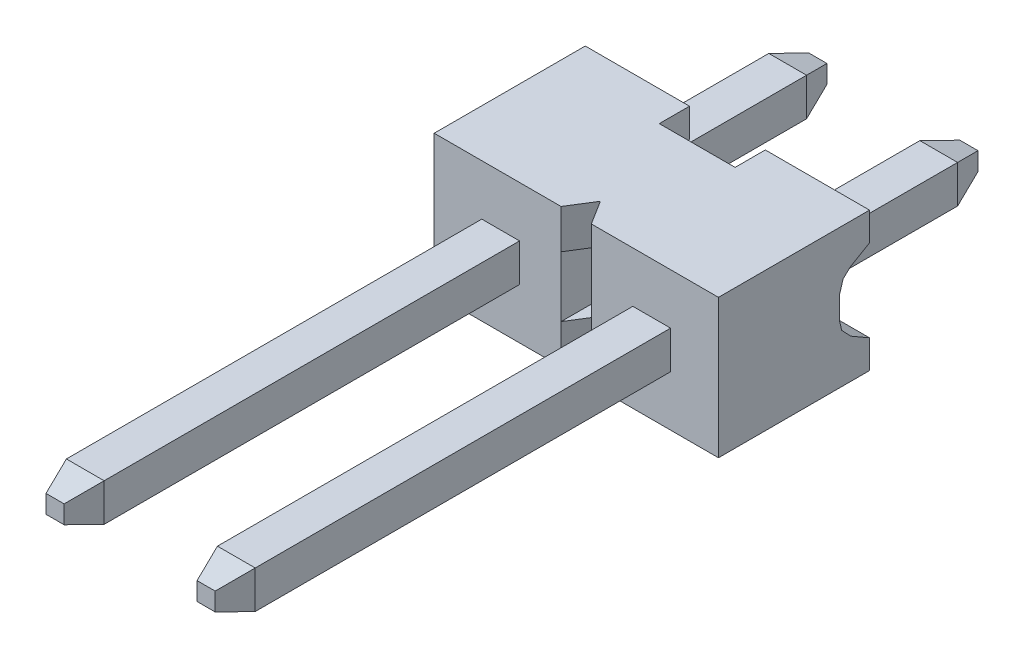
ISO-10303-21;
HEADER;
FILE_DESCRIPTION(('STEP AP214'),'2;1');
FILE_NAME('part.step','',(''),(''),'','','');
FILE_SCHEMA(('AUTOMOTIVE_DESIGN { 1 0 10303 214 1 1 1 1 }'));
ENDSEC;
DATA;
#1=APPLICATION_CONTEXT('core data for automotive mechanical design processes');
#2=APPLICATION_PROTOCOL_DEFINITION('international standard','automotive_design',2000,#1);
#3=PRODUCT_CONTEXT('',#1,'mechanical');
#4=PRODUCT('Part','Part','',(#3));
#5=PRODUCT_RELATED_PRODUCT_CATEGORY('part','',(#4));
#6=PRODUCT_DEFINITION_FORMATION('','',#4);
#7=PRODUCT_DEFINITION_CONTEXT('part definition',#1,'design');
#8=PRODUCT_DEFINITION('design','',#6,#7);
#9=PRODUCT_DEFINITION_SHAPE('','',#8);
#10=(LENGTH_UNIT() NAMED_UNIT(*) SI_UNIT(.MILLI.,.METRE.));
#11=(NAMED_UNIT(*) PLANE_ANGLE_UNIT() SI_UNIT($,.RADIAN.));
#12=(NAMED_UNIT(*) SI_UNIT($,.STERADIAN.) SOLID_ANGLE_UNIT());
#13=UNCERTAINTY_MEASURE_WITH_UNIT(LENGTH_MEASURE(1.E-05),#10,'distance_accuracy_value','');
#14=(GEOMETRIC_REPRESENTATION_CONTEXT(3) GLOBAL_UNCERTAINTY_ASSIGNED_CONTEXT((#13)) GLOBAL_UNIT_ASSIGNED_CONTEXT((#10,
#11,#12)) REPRESENTATION_CONTEXT('',''));
#15=CARTESIAN_POINT('',(0.,0.,0.));
#16=DIRECTION('',(0.,0.,1.));
#17=DIRECTION('',(1.,0.,0.));
#18=AXIS2_PLACEMENT_3D('',#15,#16,#17);
#19=CARTESIAN_POINT('',(-1.489341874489,0.119252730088,-2.58810968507));
#20=DIRECTION('',(-0.951034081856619,0.,-0.309086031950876));
#21=DIRECTION('',(-0.309086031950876,0.,0.951034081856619));
#22=AXIS2_PLACEMENT_3D('',#19,#20,#21);
#23=PLANE('',#22);
#24=DIRECTION('',(-0.295302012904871,0.295302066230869,0.908621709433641));
#25=VECTOR('',#24,1.);
#26=CARTESIAN_POINT('',(-1.422790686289,0.150974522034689,-2.79288260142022));
#27=LINE('',#26,#25);
#28=CARTESIAN_POINT('',(-1.4227906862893,0.150974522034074,-2.79288260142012));
#29=VERTEX_POINT('',#28);
#30=CARTESIAN_POINT('',(-1.58782466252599,0.316008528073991,-2.28508567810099));
#31=VERTEX_POINT('',#30);
#32=EDGE_CURVE('E413',#29,#31,#27,.T.);
#33=ORIENTED_EDGE('',*,*,#32,.F.);
#34=DIRECTION('',(0.,1.,0.));
#35=VECTOR('',#34,1.);
#36=CARTESIAN_POINT('',(-1.422790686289,-0.153703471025,-2.79288260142));
#37=LINE('',#36,#35);
#38=CARTESIAN_POINT('',(-1.42279068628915,-0.153703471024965,-2.79288260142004));
#39=VERTEX_POINT('',#38);
#40=EDGE_CURVE('E404',#29,#39,#37,.F.);
#41=ORIENTED_EDGE('',*,*,#40,.T.);
#42=DIRECTION('',(0.295302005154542,0.295302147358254,-0.908621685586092));
#43=VECTOR('',#42,1.);
#44=CARTESIAN_POINT('',(-1.587824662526,-0.318737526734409,-2.28508567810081));
#45=LINE('',#44,#43);
#46=CARTESIAN_POINT('',(-1.58782466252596,-0.318737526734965,-2.28508567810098));
#47=VERTEX_POINT('',#46);
#48=EDGE_CURVE('E395',#47,#39,#45,.T.);
#49=ORIENTED_EDGE('',*,*,#48,.F.);
#50=DIRECTION('',(0.,1.,0.));
#51=VECTOR('',#50,1.);
#52=CARTESIAN_POINT('',(-1.58782466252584,-0.153703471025,-2.28508567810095));
#53=LINE('',#52,#51);
#54=EDGE_CURVE('E20',#31,#47,#53,.F.);
#55=ORIENTED_EDGE('',*,*,#54,.F.);
#56=EDGE_LOOP('',(#33,#41,#49,#55));
#57=FACE_BOUND('',#56,.T.);
#58=ADVANCED_FACE('F17',(#57),#23,.T.);
#59=CARTESIAN_POINT('',(-0.953078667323,0.316008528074,-2.285085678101));
#60=DIRECTION('',(0.,-1.,0.));
#61=DIRECTION('',(0.,0.,-1.));
#62=AXIS2_PLACEMENT_3D('',#59,#60,#61);
#63=PLANE('',#62);
#64=DIRECTION('',(1.,0.,0.));
#65=VECTOR('',#64,1.);
#66=CARTESIAN_POINT('',(-1.308551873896,0.316008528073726,-2.28508567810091));
#67=LINE('',#66,#65);
#68=CARTESIAN_POINT('',(-0.953078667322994,0.316008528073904,-2.28508567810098));
#69=VERTEX_POINT('',#68);
#70=EDGE_CURVE('E704',#31,#69,#67,.T.);
#71=ORIENTED_EDGE('',*,*,#70,.F.);
#72=DIRECTION('',(0.,0.,-1.));
#73=VECTOR('',#72,1.);
#74=CARTESIAN_POINT('',(-1.587824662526,0.316008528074,0.481271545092));
#75=LINE('',#74,#73);
#76=CARTESIAN_POINT('',(-1.587824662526,0.316008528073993,0.481271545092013));
#77=VERTEX_POINT('',#76);
#78=EDGE_CURVE('E405',#77,#31,#75,.T.);
#79=ORIENTED_EDGE('',*,*,#78,.F.);
#80=DIRECTION('',(1.,0.,0.));
#81=VECTOR('',#80,1.);
#82=CARTESIAN_POINT('',(-1.110124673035,0.316008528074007,0.481271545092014));
#83=LINE('',#82,#81);
#84=CARTESIAN_POINT('',(-0.953078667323,0.316008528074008,0.481271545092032));
#85=VERTEX_POINT('',#84);
#86=EDGE_CURVE('E713',#85,#77,#83,.F.);
#87=ORIENTED_EDGE('',*,*,#86,.F.);
#88=DIRECTION('',(0.,0.,1.));
#89=VECTOR('',#88,1.);
#90=CARTESIAN_POINT('',(-0.953078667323,0.316008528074,-2.285085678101));
#91=LINE('',#90,#89);
#92=EDGE_CURVE('E430',#85,#69,#91,.F.);
#93=ORIENTED_EDGE('',*,*,#92,.T.);
#94=EDGE_LOOP('',(#71,#79,#87,#93));
#95=FACE_BOUND('',#94,.T.);
#96=ADVANCED_FACE('F709',(#95),#63,.F.);
#97=CARTESIAN_POINT('',(-1.232351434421,-0.263718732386,-2.454374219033));
#98=DIRECTION('',(0.,-0.951034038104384,-0.309086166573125));
#99=DIRECTION('',(0.,0.309086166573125,-0.951034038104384));
#100=AXIS2_PLACEMENT_3D('',#97,#98,#99);
#101=PLANE('',#100);
#102=DIRECTION('',(1.,0.,0.));
#103=VECTOR('',#102,1.);
#104=CARTESIAN_POINT('',(-0.953078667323,-0.318737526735,-2.285085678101));
#105=LINE('',#104,#103);
#106=CARTESIAN_POINT('',(-0.953078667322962,-0.318737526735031,-2.28508567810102));
#107=VERTEX_POINT('',#106);
#108=EDGE_CURVE('E401',#107,#47,#105,.F.);
#109=ORIENTED_EDGE('',*,*,#108,.T.);
#110=ORIENTED_EDGE('',*,*,#48,.T.);
#111=DIRECTION('',(1.,0.,0.));
#112=VECTOR('',#111,1.);
#113=CARTESIAN_POINT('',(-1.118112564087,-0.153703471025,-2.79288260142));
#114=LINE('',#113,#112);
#115=CARTESIAN_POINT('',(-1.118112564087,-0.153703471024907,-2.79288260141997));
#116=VERTEX_POINT('',#115);
#117=EDGE_CURVE('E399',#39,#116,#114,.T.);
#118=ORIENTED_EDGE('',*,*,#117,.T.);
#119=DIRECTION('',(-0.295301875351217,0.295302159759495,-0.908621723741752));
#120=VECTOR('',#119,1.);
#121=CARTESIAN_POINT('',(-0.953078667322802,-0.318737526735,-2.28508567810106));
#122=LINE('',#121,#120);
#123=EDGE_CURVE('E697',#107,#116,#122,.T.);
#124=ORIENTED_EDGE('',*,*,#123,.F.);
#125=EDGE_LOOP('',(#109,#110,#118,#124));
#126=FACE_BOUND('',#125,.T.);
#127=ADVANCED_FACE('F397',(#126),#101,.T.);
#128=CARTESIAN_POINT('',(-1.118112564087,-0.153703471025,-2.79288260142));
#129=DIRECTION('',(0.,0.,1.));
#130=DIRECTION('',(1.,0.,0.));
#131=AXIS2_PLACEMENT_3D('',#128,#129,#130);
#132=PLANE('',#131);
#133=DIRECTION('',(1.,0.,0.));
#134=VECTOR('',#133,1.);
#135=CARTESIAN_POINT('',(-1.149834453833,0.150974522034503,-2.79288260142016));
#136=LINE('',#135,#134);
#137=CARTESIAN_POINT('',(-1.11811256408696,0.150974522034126,-2.79288260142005));
#138=VERTEX_POINT('',#137);
#139=EDGE_CURVE('E699',#138,#29,#136,.F.);
#140=ORIENTED_EDGE('',*,*,#139,.F.);
#141=DIRECTION('',(0.,1.,0.));
#142=VECTOR('',#141,1.);
#143=CARTESIAN_POINT('',(-1.11811256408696,-0.121981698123,-2.79288260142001));
#144=LINE('',#143,#142);
#145=EDGE_CURVE('E412',#116,#138,#144,.T.);
#146=ORIENTED_EDGE('',*,*,#145,.F.);
#147=ORIENTED_EDGE('',*,*,#117,.F.);
#148=ORIENTED_EDGE('',*,*,#40,.F.);
#149=EDGE_LOOP('',(#140,#146,#147,#148));
#150=FACE_BOUND('',#149,.T.);
#151=ADVANCED_FACE('F410',(#150),#132,.F.);
#152=CARTESIAN_POINT('',(-1.149834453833,0.217525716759,-2.588109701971));
#153=DIRECTION('',(0.,0.951034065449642,-0.309086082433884));
#154=DIRECTION('',(0.,0.309086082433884,0.951034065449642));
#155=AXIS2_PLACEMENT_3D('',#152,#153,#154);
#156=PLANE('',#155);
#157=ORIENTED_EDGE('',*,*,#139,.T.);
#158=ORIENTED_EDGE('',*,*,#32,.T.);
#159=ORIENTED_EDGE('',*,*,#70,.T.);
#160=DIRECTION('',(-0.295301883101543,-0.295302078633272,-0.908621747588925));
#161=VECTOR('',#160,1.);
#162=CARTESIAN_POINT('',(-0.953078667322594,0.316008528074,-2.28508567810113));
#163=LINE('',#162,#161);
#164=EDGE_CURVE('E693',#69,#138,#163,.T.);
#165=ORIENTED_EDGE('',*,*,#164,.T.);
#166=EDGE_LOOP('',(#157,#158,#159,#165));
#167=FACE_BOUND('',#166,.T.);
#168=ADVANCED_FACE('F707',(#167),#156,.T.);
#169=CARTESIAN_POINT('',(-0.953078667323,-0.318737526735,-2.285085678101));
#170=DIRECTION('',(0.,1.,0.));
#171=DIRECTION('',(0.,0.,1.));
#172=AXIS2_PLACEMENT_3D('',#169,#170,#171);
#173=PLANE('',#172);
#174=DIRECTION('',(1.,0.,0.));
#175=VECTOR('',#174,1.);
#176=CARTESIAN_POINT('',(-1.670415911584,-0.318737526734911,0.481271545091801));
#177=LINE('',#176,#175);
#178=CARTESIAN_POINT('',(-1.587824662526,-0.318737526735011,0.481271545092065));
#179=VERTEX_POINT('',#178);
#180=CARTESIAN_POINT('',(-0.953078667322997,-0.318737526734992,0.481271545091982));
#181=VERTEX_POINT('',#180);
#182=EDGE_CURVE('E452',#179,#181,#177,.T.);
#183=ORIENTED_EDGE('',*,*,#182,.F.);
#184=DIRECTION('',(0.,0.,1.));
#185=VECTOR('',#184,1.);
#186=CARTESIAN_POINT('',(-1.587824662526,-0.318737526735,-2.285085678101));
#187=LINE('',#186,#185);
#188=EDGE_CURVE('E424',#47,#179,#187,.T.);
#189=ORIENTED_EDGE('',*,*,#188,.F.);
#190=ORIENTED_EDGE('',*,*,#108,.F.);
#191=DIRECTION('',(0.,0.,1.));
#192=VECTOR('',#191,1.);
#193=CARTESIAN_POINT('',(-0.953078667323,-0.318737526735,-2.285085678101));
#194=LINE('',#193,#192);
#195=EDGE_CURVE('E455',#107,#181,#194,.T.);
#196=ORIENTED_EDGE('',*,*,#195,.T.);
#197=EDGE_LOOP('',(#183,#189,#190,#196));
#198=FACE_BOUND('',#197,.T.);
#199=ADVANCED_FACE('F453',(#198),#173,.F.);
#200=CARTESIAN_POINT('',(-1.008097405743,0.03673570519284,-2.454374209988));
#201=DIRECTION('',(-0.951034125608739,0.,0.309085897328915));
#202=DIRECTION('',(0.309085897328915,0.,0.951034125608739));
#203=AXIS2_PLACEMENT_3D('',#200,#201,#202);
#204=PLANE('',#203);
#205=ORIENTED_EDGE('',*,*,#164,.F.);
#206=DIRECTION('',(0.,1.,0.));
#207=VECTOR('',#206,1.);
#208=CARTESIAN_POINT('',(-0.953078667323,-0.318737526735,-2.285085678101));
#209=LINE('',#208,#207);
#210=EDGE_CURVE('E689',#69,#107,#209,.F.);
#211=ORIENTED_EDGE('',*,*,#210,.T.);
#212=ORIENTED_EDGE('',*,*,#123,.T.);
#213=ORIENTED_EDGE('',*,*,#145,.T.);
#214=EDGE_LOOP('',(#205,#211,#212,#213));
#215=FACE_BOUND('',#214,.T.);
#216=ADVANCED_FACE('F720',(#215),#204,.F.);
#217=CARTESIAN_POINT('',(1.585905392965,-0.318737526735,-2.285085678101));
#218=DIRECTION('',(-0.951034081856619,0.,0.309086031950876));
#219=DIRECTION('',(0.309086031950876,0.,0.951034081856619));
#220=AXIS2_PLACEMENT_3D('',#217,#218,#219);
#221=PLANE('',#220);
#222=DIRECTION('',(0.,1.,0.));
#223=VECTOR('',#222,1.);
#224=CARTESIAN_POINT('',(1.42087141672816,-0.318737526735,-2.79288260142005));
#225=LINE('',#224,#223);
#226=CARTESIAN_POINT('',(1.42087141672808,0.150974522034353,-2.79288260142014));
#227=VERTEX_POINT('',#226);
#228=CARTESIAN_POINT('',(1.42087141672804,-0.153703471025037,-2.79288260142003));
#229=VERTEX_POINT('',#228);
#230=EDGE_CURVE('E681',#227,#229,#225,.F.);
#231=ORIENTED_EDGE('',*,*,#230,.F.);
#232=DIRECTION('',(0.295302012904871,0.295302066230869,0.908621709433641));
#233=VECTOR('',#232,1.);
#234=CARTESIAN_POINT('',(1.420871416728,0.150974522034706,-2.79288260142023));
#235=LINE('',#234,#233);
#236=CARTESIAN_POINT('',(1.58590539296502,0.316008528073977,-2.28508567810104));
#237=VERTEX_POINT('',#236);
#238=EDGE_CURVE('E683',#227,#237,#235,.T.);
#239=ORIENTED_EDGE('',*,*,#238,.T.);
#240=DIRECTION('',(0.,1.,0.));
#241=VECTOR('',#240,1.);
#242=CARTESIAN_POINT('',(1.585905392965,-0.318737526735,-2.285085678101));
#243=LINE('',#242,#241);
#244=CARTESIAN_POINT('',(1.58590539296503,-0.318737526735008,-2.28508567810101));
#245=VERTEX_POINT('',#244);
#246=EDGE_CURVE('E678',#237,#245,#243,.F.);
#247=ORIENTED_EDGE('',*,*,#246,.T.);
#248=DIRECTION('',(-0.295302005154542,0.295302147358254,-0.908621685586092));
#249=VECTOR('',#248,1.);
#250=CARTESIAN_POINT('',(1.585905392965,-0.31873752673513,-2.28508567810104));
#251=LINE('',#250,#249);
#252=EDGE_CURVE('E675',#245,#229,#251,.T.);
#253=ORIENTED_EDGE('',*,*,#252,.T.);
#254=EDGE_LOOP('',(#231,#239,#247,#253));
#255=FACE_BOUND('',#254,.T.);
#256=ADVANCED_FACE('F1338',(#255),#221,.F.);
#257=CARTESIAN_POINT('',(1.420871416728,-0.153703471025,-2.79288260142));
#258=DIRECTION('',(0.,0.,1.));
#259=DIRECTION('',(1.,0.,0.));
#260=AXIS2_PLACEMENT_3D('',#257,#258,#259);
#261=PLANE('',#260);
#262=DIRECTION('',(0.,1.,0.));
#263=VECTOR('',#262,1.);
#264=CARTESIAN_POINT('',(1.11619337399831,0.119252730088,-2.7928826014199));
#265=LINE('',#264,#263);
#266=CARTESIAN_POINT('',(1.11619337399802,0.150974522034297,-2.79288260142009));
#267=VERTEX_POINT('',#266);
#268=CARTESIAN_POINT('',(1.11619337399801,-0.153703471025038,-2.79288260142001));
#269=VERTEX_POINT('',#268);
#270=EDGE_CURVE('E664',#267,#269,#265,.F.);
#271=ORIENTED_EDGE('',*,*,#270,.F.);
#272=DIRECTION('',(1.,0.,0.));
#273=VECTOR('',#272,1.);
#274=CARTESIAN_POINT('',(1.389149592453,0.150974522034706,-2.79288260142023));
#275=LINE('',#274,#273);
#276=EDGE_CURVE('E686',#267,#227,#275,.T.);
#277=ORIENTED_EDGE('',*,*,#276,.T.);
#278=ORIENTED_EDGE('',*,*,#230,.T.);
#279=DIRECTION('',(1.,0.,0.));
#280=VECTOR('',#279,1.);
#281=CARTESIAN_POINT('',(1.147915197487,-0.15370347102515,-2.79288260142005));
#282=LINE('',#281,#280);
#283=EDGE_CURVE('E669',#229,#269,#282,.F.);
#284=ORIENTED_EDGE('',*,*,#283,.T.);
#285=EDGE_LOOP('',(#271,#277,#278,#284));
#286=FACE_BOUND('',#285,.T.);
#287=ADVANCED_FACE('F1334',(#286),#261,.F.);
#288=CARTESIAN_POINT('',(1.585905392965,0.316008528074,-2.285085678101));
#289=DIRECTION('',(0.,-0.951034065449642,0.309086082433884));
#290=DIRECTION('',(0.,-0.309086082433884,-0.951034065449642));
#291=AXIS2_PLACEMENT_3D('',#288,#289,#290);
#292=PLANE('',#291);
#293=DIRECTION('',(0.295302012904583,-0.295302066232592,-0.908621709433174));
#294=VECTOR('',#293,1.);
#295=CARTESIAN_POINT('',(0.951159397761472,0.316008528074,-2.28508567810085));
#296=LINE('',#295,#294);
#297=CARTESIAN_POINT('',(0.951159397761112,0.316008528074,-2.28508567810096));
#298=VERTEX_POINT('',#297);
#299=EDGE_CURVE('E666',#298,#267,#296,.T.);
#300=ORIENTED_EDGE('',*,*,#299,.F.);
#301=DIRECTION('',(1.,0.,0.));
#302=VECTOR('',#301,1.);
#303=CARTESIAN_POINT('',(1.585905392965,0.316008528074,-2.285085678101));
#304=LINE('',#303,#302);
#305=EDGE_CURVE('E660',#298,#237,#304,.T.);
#306=ORIENTED_EDGE('',*,*,#305,.T.);
#307=ORIENTED_EDGE('',*,*,#238,.F.);
#308=ORIENTED_EDGE('',*,*,#276,.F.);
#309=EDGE_LOOP('',(#300,#306,#307,#308));
#310=FACE_BOUND('',#309,.T.);
#311=ADVANCED_FACE('F1330',(#310),#292,.F.);
#312=CARTESIAN_POINT('',(1.147915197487,-0.220254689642,-2.588109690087));
#313=DIRECTION('',(0.,0.951034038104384,0.309086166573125));
#314=DIRECTION('',(0.,-0.309086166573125,0.951034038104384));
#315=AXIS2_PLACEMENT_3D('',#312,#313,#314);
#316=PLANE('',#315);
#317=DIRECTION('',(-0.295302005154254,-0.295302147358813,0.908621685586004));
#318=VECTOR('',#317,1.);
#319=CARTESIAN_POINT('',(1.11619337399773,-0.153703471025,-2.79288260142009));
#320=LINE('',#319,#318);
#321=CARTESIAN_POINT('',(0.951159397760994,-0.318737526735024,-2.28508567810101));
#322=VERTEX_POINT('',#321);
#323=EDGE_CURVE('E655',#269,#322,#320,.T.);
#324=ORIENTED_EDGE('',*,*,#323,.F.);
#325=ORIENTED_EDGE('',*,*,#283,.F.);
#326=ORIENTED_EDGE('',*,*,#252,.F.);
#327=DIRECTION('',(1.,0.,0.));
#328=VECTOR('',#327,1.);
#329=CARTESIAN_POINT('',(1.585905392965,-0.318737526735,-2.285085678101));
#330=LINE('',#329,#328);
#331=EDGE_CURVE('E657',#245,#322,#330,.F.);
#332=ORIENTED_EDGE('',*,*,#331,.T.);
#333=EDGE_LOOP('',(#324,#325,#326,#332));
#334=FACE_BOUND('',#333,.T.);
#335=ADVANCED_FACE('F1326',(#334),#316,.F.);
#336=CARTESIAN_POINT('',(1.585905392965,-0.318737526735,-2.285085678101));
#337=DIRECTION('',(0.,1.,0.));
#338=DIRECTION('',(0.,0.,1.));
#339=AXIS2_PLACEMENT_3D('',#336,#337,#338);
#340=PLANE('',#339);
#341=DIRECTION('',(0.,0.,-1.));
#342=VECTOR('',#341,1.);
#343=CARTESIAN_POINT('',(0.951159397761,-0.318737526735,-2.285085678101));
#344=LINE('',#343,#342);
#345=CARTESIAN_POINT('',(0.951159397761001,-0.31873752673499,0.481271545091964));
#346=VERTEX_POINT('',#345);
#347=EDGE_CURVE('E652',#346,#322,#344,.T.);
#348=ORIENTED_EDGE('',*,*,#347,.T.);
#349=ORIENTED_EDGE('',*,*,#331,.F.);
#350=DIRECTION('',(0.,0.,1.));
#351=VECTOR('',#350,1.);
#352=CARTESIAN_POINT('',(1.585905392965,-0.318737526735,-2.285085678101));
#353=LINE('',#352,#351);
#354=CARTESIAN_POINT('',(1.58590539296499,-0.318737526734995,0.481271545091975));
#355=VERTEX_POINT('',#354);
#356=EDGE_CURVE('E672',#355,#245,#353,.F.);
#357=ORIENTED_EDGE('',*,*,#356,.F.);
#358=DIRECTION('',(1.,0.,0.));
#359=VECTOR('',#358,1.);
#360=CARTESIAN_POINT('',(1.111958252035,-0.318737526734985,0.481271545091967));
#361=LINE('',#360,#359);
#362=EDGE_CURVE('E808',#355,#346,#361,.F.);
#363=ORIENTED_EDGE('',*,*,#362,.T.);
#364=EDGE_LOOP('',(#348,#349,#357,#363));
#365=FACE_BOUND('',#364,.T.);
#366=ADVANCED_FACE('F1322',(#365),#340,.F.);
#367=CARTESIAN_POINT('',(1.006178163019,-0.03946469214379,-2.454374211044));
#368=DIRECTION('',(-0.951034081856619,0.,-0.309086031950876));
#369=DIRECTION('',(-0.309086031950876,0.,0.951034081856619));
#370=AXIS2_PLACEMENT_3D('',#367,#368,#369);
#371=PLANE('',#370);
#372=DIRECTION('',(0.,1.,0.));
#373=VECTOR('',#372,1.);
#374=CARTESIAN_POINT('',(0.951159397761,-0.318737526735,-2.285085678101));
#375=LINE('',#374,#373);
#376=EDGE_CURVE('E649',#322,#298,#375,.T.);
#377=ORIENTED_EDGE('',*,*,#376,.T.);
#378=ORIENTED_EDGE('',*,*,#299,.T.);
#379=ORIENTED_EDGE('',*,*,#270,.T.);
#380=ORIENTED_EDGE('',*,*,#323,.T.);
#381=EDGE_LOOP('',(#377,#378,#379,#380));
#382=FACE_BOUND('',#381,.T.);
#383=ADVANCED_FACE('F1318',(#382),#371,.T.);
#384=CARTESIAN_POINT('',(1.585905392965,0.316008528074,0.481271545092));
#385=DIRECTION('',(0.,-1.,0.));
#386=DIRECTION('',(0.,0.,-1.));
#387=AXIS2_PLACEMENT_3D('',#384,#385,#386);
#388=PLANE('',#387);
#389=DIRECTION('',(0.,0.,-1.));
#390=VECTOR('',#389,1.);
#391=CARTESIAN_POINT('',(0.951159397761,0.316008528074,-2.285085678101));
#392=LINE('',#391,#390);
#393=CARTESIAN_POINT('',(0.951159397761,0.316008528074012,0.481271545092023));
#394=VERTEX_POINT('',#393);
#395=EDGE_CURVE('E646',#298,#394,#392,.F.);
#396=ORIENTED_EDGE('',*,*,#395,.T.);
#397=DIRECTION('',(1.,0.,0.));
#398=VECTOR('',#397,1.);
#399=CARTESIAN_POINT('',(2.39048353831,0.316008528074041,0.481271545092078));
#400=LINE('',#399,#398);
#401=CARTESIAN_POINT('',(1.585905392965,0.316008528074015,0.48127154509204));
#402=VERTEX_POINT('',#401);
#403=EDGE_CURVE('E979',#394,#402,#400,.T.);
#404=ORIENTED_EDGE('',*,*,#403,.T.);
#405=DIRECTION('',(0.,0.,-1.));
#406=VECTOR('',#405,1.);
#407=CARTESIAN_POINT('',(1.585905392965,0.316008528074,-2.285085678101));
#408=LINE('',#407,#406);
#409=EDGE_CURVE('E662',#237,#402,#408,.F.);
#410=ORIENTED_EDGE('',*,*,#409,.F.);
#411=ORIENTED_EDGE('',*,*,#305,.F.);
#412=EDGE_LOOP('',(#396,#404,#410,#411));
#413=FACE_BOUND('',#412,.T.);
#414=ADVANCED_FACE('F1314',(#413),#388,.F.);
#415=CARTESIAN_POINT('',(1.420871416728,-0.153703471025,10.028986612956));
#416=DIRECTION('',(0.,0.,-1.));
#417=DIRECTION('',(-1.,0.,0.));
#418=AXIS2_PLACEMENT_3D('',#415,#416,#417);
#419=PLANE('',#418);
#420=DIRECTION('',(0.,1.,0.));
#421=VECTOR('',#420,1.);
#422=CARTESIAN_POINT('',(1.42087141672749,0.119252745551,10.0289866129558));
#423=LINE('',#422,#421);
#424=CARTESIAN_POINT('',(1.42087141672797,0.150974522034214,10.0289866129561));
#425=VERTEX_POINT('',#424);
#426=CARTESIAN_POINT('',(1.42087141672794,-0.153703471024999,10.028986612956));
#427=VERTEX_POINT('',#426);
#428=EDGE_CURVE('E628',#425,#427,#423,.F.);
#429=ORIENTED_EDGE('',*,*,#428,.F.);
#430=DIRECTION('',(-1.,0.,0.));
#431=VECTOR('',#430,1.);
#432=CARTESIAN_POINT('',(1.420871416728,0.150974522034,10.028986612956));
#433=LINE('',#432,#431);
#434=CARTESIAN_POINT('',(1.116193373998,0.15097452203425,10.0289866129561));
#435=VERTEX_POINT('',#434);
#436=EDGE_CURVE('E641',#435,#425,#433,.F.);
#437=ORIENTED_EDGE('',*,*,#436,.F.);
#438=DIRECTION('',(0.,1.,0.));
#439=VECTOR('',#438,1.);
#440=CARTESIAN_POINT('',(1.116193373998,-0.153703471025,10.028986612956));
#441=LINE('',#440,#439);
#442=CARTESIAN_POINT('',(1.116193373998,-0.153703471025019,10.028986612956));
#443=VERTEX_POINT('',#442);
#444=EDGE_CURVE('E636',#435,#443,#441,.F.);
#445=ORIENTED_EDGE('',*,*,#444,.T.);
#446=DIRECTION('',(1.,0.,0.));
#447=VECTOR('',#446,1.);
#448=CARTESIAN_POINT('',(1.389149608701,-0.153703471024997,10.028986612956));
#449=LINE('',#448,#447);
#450=EDGE_CURVE('E633',#443,#427,#449,.T.);
#451=ORIENTED_EDGE('',*,*,#450,.T.);
#452=EDGE_LOOP('',(#429,#437,#445,#451));
#453=FACE_BOUND('',#452,.T.);
#454=ADVANCED_FACE('F1310',(#453),#419,.F.);
#455=CARTESIAN_POINT('',(1.585905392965,0.316008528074,9.521189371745));
#456=DIRECTION('',(0.,-0.951034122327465,-0.309085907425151));
#457=DIRECTION('',(0.,0.309085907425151,-0.951034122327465));
#458=AXIS2_PLACEMENT_3D('',#455,#456,#457);
#459=PLANE('',#458);
#460=DIRECTION('',(1.,0.,0.));
#461=VECTOR('',#460,1.);
#462=CARTESIAN_POINT('',(1.585905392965,0.316008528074,9.521189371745));
#463=LINE('',#462,#461);
#464=CARTESIAN_POINT('',(1.5859053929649,0.316008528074,9.52118937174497));
#465=VERTEX_POINT('',#464);
#466=CARTESIAN_POINT('',(0.95115939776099,0.316008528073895,9.52118937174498));
#467=VERTEX_POINT('',#466);
#468=EDGE_CURVE('E625',#465,#467,#463,.F.);
#469=ORIENTED_EDGE('',*,*,#468,.T.);
#470=DIRECTION('',(0.295301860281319,-0.295301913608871,0.908621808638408));
#471=VECTOR('',#470,1.);
#472=CARTESIAN_POINT('',(0.951159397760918,0.316008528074,9.52118937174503));
#473=LINE('',#472,#471);
#474=EDGE_CURVE('E643',#467,#435,#473,.T.);
#475=ORIENTED_EDGE('',*,*,#474,.T.);
#476=ORIENTED_EDGE('',*,*,#436,.T.);
#477=DIRECTION('',(-0.295301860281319,-0.295301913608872,0.908621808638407));
#478=VECTOR('',#477,1.);
#479=CARTESIAN_POINT('',(1.58590539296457,0.316008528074,9.52118937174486));
#480=LINE('',#479,#478);
#481=EDGE_CURVE('E630',#465,#425,#480,.T.);
#482=ORIENTED_EDGE('',*,*,#481,.F.);
#483=EDGE_LOOP('',(#469,#475,#476,#482));
#484=FACE_BOUND('',#483,.T.);
#485=ADVANCED_FACE('F1306',(#484),#459,.F.);
#486=CARTESIAN_POINT('',(0.951159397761,-0.318737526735,2.538983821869));
#487=DIRECTION('',(1.,0.,0.));
#488=DIRECTION('',(0.,0.,-1.));
#489=AXIS2_PLACEMENT_3D('',#486,#487,#488);
#490=PLANE('',#489);
#491=DIRECTION('',(0.,1.,0.));
#492=VECTOR('',#491,1.);
#493=CARTESIAN_POINT('',(0.951159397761,-0.318737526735,9.521189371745));
#494=LINE('',#493,#492);
#495=CARTESIAN_POINT('',(0.951159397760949,-0.318737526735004,9.52118937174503));
#496=VERTEX_POINT('',#495);
#497=EDGE_CURVE('E639',#467,#496,#494,.F.);
#498=ORIENTED_EDGE('',*,*,#497,.F.);
#499=DIRECTION('',(0.,0.,-1.));
#500=VECTOR('',#499,1.);
#501=CARTESIAN_POINT('',(0.951159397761,0.316008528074,9.521189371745));
#502=LINE('',#501,#500);
#503=CARTESIAN_POINT('',(0.951159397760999,0.316008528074,2.53898382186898));
#504=VERTEX_POINT('',#503);
#505=EDGE_CURVE('E622',#467,#504,#502,.T.);
#506=ORIENTED_EDGE('',*,*,#505,.T.);
#507=DIRECTION('',(0.,1.,0.));
#508=VECTOR('',#507,1.);
#509=CARTESIAN_POINT('',(0.951159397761,-0.318737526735,2.538983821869));
#510=LINE('',#509,#508);
#511=CARTESIAN_POINT('',(0.951159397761,-0.318737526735,2.538983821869));
#512=VERTEX_POINT('',#511);
#513=EDGE_CURVE('E990',#504,#512,#510,.F.);
#514=ORIENTED_EDGE('',*,*,#513,.T.);
#515=DIRECTION('',(0.,0.,1.));
#516=VECTOR('',#515,1.);
#517=CARTESIAN_POINT('',(0.951159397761,-0.318737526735,2.538983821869));
#518=LINE('',#517,#516);
#519=EDGE_CURVE('E619',#512,#496,#518,.T.);
#520=ORIENTED_EDGE('',*,*,#519,.T.);
#521=EDGE_LOOP('',(#498,#506,#514,#520));
#522=FACE_BOUND('',#521,.T.);
#523=ADVANCED_FACE('F1302',(#522),#490,.F.);
#524=CARTESIAN_POINT('',(1.116193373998,-0.153703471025,10.028986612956));
#525=DIRECTION('',(0.951034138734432,0.,-0.30908585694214));
#526=DIRECTION('',(-0.30908585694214,0.,-0.951034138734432));
#527=AXIS2_PLACEMENT_3D('',#524,#525,#526);
#528=PLANE('',#527);
#529=ORIENTED_EDGE('',*,*,#444,.F.);
#530=ORIENTED_EDGE('',*,*,#474,.F.);
#531=ORIENTED_EDGE('',*,*,#497,.T.);
#532=DIRECTION('',(0.29530185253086,0.295301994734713,0.908621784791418));
#533=VECTOR('',#532,1.);
#534=CARTESIAN_POINT('',(0.951159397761,-0.318737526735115,9.52118937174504));
#535=LINE('',#534,#533);
#536=EDGE_CURVE('E616',#496,#443,#535,.T.);
#537=ORIENTED_EDGE('',*,*,#536,.T.);
#538=EDGE_LOOP('',(#529,#530,#531,#537));
#539=FACE_BOUND('',#538,.T.);
#540=ADVANCED_FACE('F1298',(#539),#528,.F.);
#541=CARTESIAN_POINT('',(1.230432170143,-0.263718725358,9.69047804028));
#542=DIRECTION('',(0.,0.951034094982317,-0.309085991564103));
#543=DIRECTION('',(0.,0.309085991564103,0.951034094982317));
#544=AXIS2_PLACEMENT_3D('',#541,#542,#543);
#545=PLANE('',#544);
#546=ORIENTED_EDGE('',*,*,#536,.F.);
#547=DIRECTION('',(1.,0.,0.));
#548=VECTOR('',#547,1.);
#549=CARTESIAN_POINT('',(1.585905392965,-0.318737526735,9.521189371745));
#550=LINE('',#549,#548);
#551=CARTESIAN_POINT('',(1.58590539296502,-0.318737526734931,9.52118937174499));
#552=VERTEX_POINT('',#551);
#553=EDGE_CURVE('E610',#496,#552,#550,.T.);
#554=ORIENTED_EDGE('',*,*,#553,.T.);
#555=DIRECTION('',(-0.295301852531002,0.295301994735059,0.908621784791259));
#556=VECTOR('',#555,1.);
#557=CARTESIAN_POINT('',(1.58590539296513,-0.318737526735,9.52118937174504));
#558=LINE('',#557,#556);
#559=EDGE_CURVE('E613',#552,#427,#558,.T.);
#560=ORIENTED_EDGE('',*,*,#559,.T.);
#561=ORIENTED_EDGE('',*,*,#450,.F.);
#562=EDGE_LOOP('',(#546,#554,#560,#561));
#563=FACE_BOUND('',#562,.T.);
#564=ADVANCED_FACE('F1294',(#563),#545,.F.);
#565=CARTESIAN_POINT('',(1.53088662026,-0.0394647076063,9.69047803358));
#566=DIRECTION('',(-0.951034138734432,0.,-0.30908585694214));
#567=DIRECTION('',(-0.30908585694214,0.,0.951034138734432));
#568=AXIS2_PLACEMENT_3D('',#565,#566,#567);
#569=PLANE('',#568);
#570=DIRECTION('',(0.,1.,0.));
#571=VECTOR('',#570,1.);
#572=CARTESIAN_POINT('',(1.585905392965,0.316008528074,9.521189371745));
#573=LINE('',#572,#571);
#574=EDGE_CURVE('E607',#552,#465,#573,.T.);
#575=ORIENTED_EDGE('',*,*,#574,.T.);
#576=ORIENTED_EDGE('',*,*,#481,.T.);
#577=ORIENTED_EDGE('',*,*,#428,.T.);
#578=ORIENTED_EDGE('',*,*,#559,.F.);
#579=EDGE_LOOP('',(#575,#576,#577,#578));
#580=FACE_BOUND('',#579,.T.);
#581=ADVANCED_FACE('F1290',(#580),#569,.F.);
#582=CARTESIAN_POINT('',(1.585905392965,0.316008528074,2.538983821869));
#583=DIRECTION('',(0.,-1.,0.));
#584=DIRECTION('',(0.,0.,-1.));
#585=AXIS2_PLACEMENT_3D('',#582,#583,#584);
#586=PLANE('',#585);
#587=DIRECTION('',(-1.,0.,0.));
#588=VECTOR('',#587,1.);
#589=CARTESIAN_POINT('',(1.585905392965,0.316008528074,2.538983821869));
#590=LINE('',#589,#588);
#591=CARTESIAN_POINT('',(1.585905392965,0.316008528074,2.538983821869));
#592=VERTEX_POINT('',#591);
#593=EDGE_CURVE('E1011',#592,#504,#590,.T.);
#594=ORIENTED_EDGE('',*,*,#593,.T.);
#595=ORIENTED_EDGE('',*,*,#505,.F.);
#596=ORIENTED_EDGE('',*,*,#468,.F.);
#597=DIRECTION('',(0.,0.,1.));
#598=VECTOR('',#597,1.);
#599=CARTESIAN_POINT('',(1.585905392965,0.316008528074,2.538983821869));
#600=LINE('',#599,#598);
#601=EDGE_CURVE('E604',#465,#592,#600,.F.);
#602=ORIENTED_EDGE('',*,*,#601,.T.);
#603=EDGE_LOOP('',(#594,#595,#596,#602));
#604=FACE_BOUND('',#603,.T.);
#605=ADVANCED_FACE('F1286',(#604),#586,.F.);
#606=CARTESIAN_POINT('',(1.585905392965,-0.318737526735,2.538983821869));
#607=DIRECTION('',(0.,1.,0.));
#608=DIRECTION('',(0.,0.,1.));
#609=AXIS2_PLACEMENT_3D('',#606,#607,#608);
#610=PLANE('',#609);
#611=ORIENTED_EDGE('',*,*,#553,.F.);
#612=ORIENTED_EDGE('',*,*,#519,.F.);
#613=DIRECTION('',(-1.,0.,0.));
#614=VECTOR('',#613,1.);
#615=CARTESIAN_POINT('',(2.39048353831,-0.318737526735,2.538983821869));
#616=LINE('',#615,#614);
#617=CARTESIAN_POINT('',(1.585905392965,-0.318737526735,2.538983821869));
#618=VERTEX_POINT('',#617);
#619=EDGE_CURVE('E930',#512,#618,#616,.F.);
#620=ORIENTED_EDGE('',*,*,#619,.T.);
#621=DIRECTION('',(0.,0.,1.));
#622=VECTOR('',#621,1.);
#623=CARTESIAN_POINT('',(1.585905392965,-0.318737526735,2.538983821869));
#624=LINE('',#623,#622);
#625=EDGE_CURVE('E601',#618,#552,#624,.T.);
#626=ORIENTED_EDGE('',*,*,#625,.T.);
#627=EDGE_LOOP('',(#611,#612,#620,#626));
#628=FACE_BOUND('',#627,.T.);
#629=ADVANCED_FACE('F1279',(#628),#610,.F.);
#630=CARTESIAN_POINT('',(1.585905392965,-0.318737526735,2.538983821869));
#631=DIRECTION('',(-1.,0.,0.));
#632=DIRECTION('',(0.,0.,1.));
#633=AXIS2_PLACEMENT_3D('',#630,#631,#632);
#634=PLANE('',#633);
#635=DIRECTION('',(0.,1.,0.));
#636=VECTOR('',#635,1.);
#637=CARTESIAN_POINT('',(1.585905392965,1.166568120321,2.538983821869));
#638=LINE('',#637,#636);
#639=EDGE_CURVE('E1008',#618,#592,#638,.T.);
#640=ORIENTED_EDGE('',*,*,#639,.T.);
#641=ORIENTED_EDGE('',*,*,#601,.F.);
#642=ORIENTED_EDGE('',*,*,#574,.F.);
#643=ORIENTED_EDGE('',*,*,#625,.F.);
#644=EDGE_LOOP('',(#640,#641,#642,#643));
#645=FACE_BOUND('',#644,.T.);
#646=ADVANCED_FACE('F1270',(#645),#634,.F.);
#647=CARTESIAN_POINT('',(-0.2548579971,0.506432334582,0.507796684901));
#648=DIRECTION('',(-1.,0.,0.));
#649=DIRECTION('',(0.,0.,1.));
#650=AXIS2_PLACEMENT_3D('',#647,#648,#649);
#651=PLANE('',#650);
#652=DIRECTION('',(0.,1.,0.));
#653=VECTOR('',#652,1.);
#654=CARTESIAN_POINT('',(-0.2548579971,0.506432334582,2.538983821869));
#655=LINE('',#654,#653);
#656=CARTESIAN_POINT('',(-0.254857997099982,-0.509161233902,2.53898382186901));
#657=VERTEX_POINT('',#656);
#658=CARTESIAN_POINT('',(-0.254857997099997,0.506432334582,2.538983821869));
#659=VERTEX_POINT('',#658);
#660=EDGE_CURVE('E591',#657,#659,#655,.T.);
#661=ORIENTED_EDGE('',*,*,#660,.F.);
#662=DIRECTION('',(0.,0.,1.));
#663=VECTOR('',#662,1.);
#664=CARTESIAN_POINT('',(-0.2548579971,-0.509161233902,0.507796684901));
#665=LINE('',#664,#663);
#666=CARTESIAN_POINT('',(-0.2548579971,-0.509161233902,0.507796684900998));
#667=VERTEX_POINT('',#666);
#668=EDGE_CURVE('E596',#667,#657,#665,.T.);
#669=ORIENTED_EDGE('',*,*,#668,.F.);
#670=DIRECTION('',(0.,1.,0.));
#671=VECTOR('',#670,1.);
#672=CARTESIAN_POINT('',(-0.2548579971,-0.509161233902,0.507796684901));
#673=LINE('',#672,#671);
#674=CARTESIAN_POINT('',(-0.2548579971,0.506432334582,0.507796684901));
#675=VERTEX_POINT('',#674);
#676=EDGE_CURVE('E593',#675,#667,#673,.F.);
#677=ORIENTED_EDGE('',*,*,#676,.F.);
#678=DIRECTION('',(0.,0.,1.));
#679=VECTOR('',#678,1.);
#680=CARTESIAN_POINT('',(-0.2548579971,0.506432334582,0.507796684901));
#681=LINE('',#680,#679);
#682=EDGE_CURVE('E585',#675,#659,#681,.T.);
#683=ORIENTED_EDGE('',*,*,#682,.T.);
#684=EDGE_LOOP('',(#661,#669,#677,#683));
#685=FACE_BOUND('',#684,.T.);
#686=ADVANCED_FACE('F1267',(#685),#651,.F.);
#687=CARTESIAN_POINT('',(-1.118112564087,0.150974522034,10.028986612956));
#688=DIRECTION('',(0.,0.,-1.));
#689=DIRECTION('',(-1.,0.,0.));
#690=AXIS2_PLACEMENT_3D('',#687,#688,#689);
#691=PLANE('',#690);
#692=DIRECTION('',(0.,1.,0.));
#693=VECTOR('',#692,1.);
#694=CARTESIAN_POINT('',(-1.4227906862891,-0.121981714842,10.028986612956));
#695=LINE('',#694,#693);
#696=CARTESIAN_POINT('',(-1.42279068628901,-0.153703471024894,10.028986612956));
#697=VERTEX_POINT('',#696);
#698=CARTESIAN_POINT('',(-1.42279068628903,0.150974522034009,10.028986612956));
#699=VERTEX_POINT('',#698);
#700=EDGE_CURVE('E567',#697,#699,#695,.T.);
#701=ORIENTED_EDGE('',*,*,#700,.F.);
#702=DIRECTION('',(-1.,0.,0.));
#703=VECTOR('',#702,1.);
#704=CARTESIAN_POINT('',(-1.118112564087,-0.153703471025,10.028986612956));
#705=LINE('',#704,#703);
#706=CARTESIAN_POINT('',(-1.11811256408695,-0.153703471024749,10.0289866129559));
#707=VERTEX_POINT('',#706);
#708=EDGE_CURVE('E583',#707,#697,#705,.T.);
#709=ORIENTED_EDGE('',*,*,#708,.F.);
#710=DIRECTION('',(0.,1.,0.));
#711=VECTOR('',#710,1.);
#712=CARTESIAN_POINT('',(-1.11811256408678,0.119252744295,10.0289866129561));
#713=LINE('',#712,#711);
#714=CARTESIAN_POINT('',(-1.11811256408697,0.150974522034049,10.028986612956));
#715=VERTEX_POINT('',#714);
#716=EDGE_CURVE('E572',#715,#707,#713,.F.);
#717=ORIENTED_EDGE('',*,*,#716,.F.);
#718=DIRECTION('',(1.,0.,0.));
#719=VECTOR('',#718,1.);
#720=CARTESIAN_POINT('',(-1.391068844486,0.150974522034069,10.028986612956));
#721=LINE('',#720,#719);
#722=EDGE_CURVE('E562',#699,#715,#721,.T.);
#723=ORIENTED_EDGE('',*,*,#722,.F.);
#724=EDGE_LOOP('',(#701,#709,#717,#723));
#725=FACE_BOUND('',#724,.T.);
#726=ADVANCED_FACE('F1269',(#725),#691,.F.);
#727=CARTESIAN_POINT('',(-1.308551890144,-0.263718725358,9.69047804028));
#728=DIRECTION('',(0.,0.951034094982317,-0.309085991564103));
#729=DIRECTION('',(0.,0.309085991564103,0.951034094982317));
#730=AXIS2_PLACEMENT_3D('',#727,#728,#729);
#731=PLANE('',#730);
#732=DIRECTION('',(0.295301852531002,0.295301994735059,0.908621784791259));
#733=VECTOR('',#732,1.);
#734=CARTESIAN_POINT('',(-1.58782466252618,-0.318737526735,9.52118937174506));
#735=LINE('',#734,#733);
#736=CARTESIAN_POINT('',(-1.58782466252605,-0.318737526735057,9.52118937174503));
#737=VERTEX_POINT('',#736);
#738=EDGE_CURVE('E564',#737,#697,#735,.T.);
#739=ORIENTED_EDGE('',*,*,#738,.F.);
#740=DIRECTION('',(1.,0.,0.));
#741=VECTOR('',#740,1.);
#742=CARTESIAN_POINT('',(-0.953078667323,-0.318737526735,9.521189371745));
#743=LINE('',#742,#741);
#744=CARTESIAN_POINT('',(-0.95307866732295,-0.318737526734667,9.52118937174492));
#745=VERTEX_POINT('',#744);
#746=EDGE_CURVE('E559',#737,#745,#743,.T.);
#747=ORIENTED_EDGE('',*,*,#746,.T.);
#748=DIRECTION('',(0.295301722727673,-0.29530200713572,-0.908621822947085));
#749=VECTOR('',#748,1.);
#750=CARTESIAN_POINT('',(-1.11811256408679,-0.153703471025,10.0289866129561));
#751=LINE('',#750,#749);
#752=EDGE_CURVE('E581',#707,#745,#751,.T.);
#753=ORIENTED_EDGE('',*,*,#752,.F.);
#754=ORIENTED_EDGE('',*,*,#708,.T.);
#755=EDGE_LOOP('',(#739,#747,#753,#754));
#756=FACE_BOUND('',#755,.T.);
#757=ADVANCED_FACE('F1276',(#756),#731,.F.);
#758=CARTESIAN_POINT('',(-1.05156140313,0.119252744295,9.824213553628));
#759=DIRECTION('',(0.951034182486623,0.,0.309085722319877));
#760=DIRECTION('',(0.309085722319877,0.,-0.951034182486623));
#761=AXIS2_PLACEMENT_3D('',#758,#759,#760);
#762=PLANE('',#761);
#763=ORIENTED_EDGE('',*,*,#716,.T.);
#764=ORIENTED_EDGE('',*,*,#752,.T.);
#765=DIRECTION('',(0.,1.,0.));
#766=VECTOR('',#765,1.);
#767=CARTESIAN_POINT('',(-0.953078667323,0.316008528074,9.521189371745));
#768=LINE('',#767,#766);
#769=CARTESIAN_POINT('',(-0.953078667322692,0.316008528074,9.52118937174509));
#770=VERTEX_POINT('',#769);
#771=EDGE_CURVE('E569',#745,#770,#768,.T.);
#772=ORIENTED_EDGE('',*,*,#771,.T.);
#773=DIRECTION('',(-0.295301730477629,-0.295301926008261,0.908621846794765));
#774=VECTOR('',#773,1.);
#775=CARTESIAN_POINT('',(-0.953078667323,0.316008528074,9.521189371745));
#776=LINE('',#775,#774);
#777=EDGE_CURVE('E548',#770,#715,#776,.T.);
#778=ORIENTED_EDGE('',*,*,#777,.T.);
#779=EDGE_LOOP('',(#763,#764,#772,#778));
#780=FACE_BOUND('',#779,.T.);
#781=ADVANCED_FACE('F1512',(#780),#762,.T.);
#782=CARTESIAN_POINT('',(-0.953078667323,0.316008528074,2.538983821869));
#783=DIRECTION('',(-1.,0.,0.));
#784=DIRECTION('',(0.,0.,1.));
#785=AXIS2_PLACEMENT_3D('',#782,#783,#784);
#786=PLANE('',#785);
#787=ORIENTED_EDGE('',*,*,#771,.F.);
#788=DIRECTION('',(0.,0.,1.));
#789=VECTOR('',#788,1.);
#790=CARTESIAN_POINT('',(-0.953078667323,-0.318737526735,2.538983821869));
#791=LINE('',#790,#789);
#792=CARTESIAN_POINT('',(-0.953078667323,-0.318737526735,2.538983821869));
#793=VERTEX_POINT('',#792);
#794=EDGE_CURVE('E556',#745,#793,#791,.F.);
#795=ORIENTED_EDGE('',*,*,#794,.T.);
#796=DIRECTION('',(0.,1.,0.));
#797=VECTOR('',#796,1.);
#798=CARTESIAN_POINT('',(-0.953078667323,-0.318737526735,2.538983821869));
#799=LINE('',#798,#797);
#800=CARTESIAN_POINT('',(-0.953078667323,0.316008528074,2.538983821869));
#801=VERTEX_POINT('',#800);
#802=EDGE_CURVE('E579',#801,#793,#799,.F.);
#803=ORIENTED_EDGE('',*,*,#802,.F.);
#804=DIRECTION('',(0.,0.,-1.));
#805=VECTOR('',#804,1.);
#806=CARTESIAN_POINT('',(-0.953078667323,0.316008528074,2.538983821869));
#807=LINE('',#806,#805);
#808=EDGE_CURVE('E545',#801,#770,#807,.F.);
#809=ORIENTED_EDGE('',*,*,#808,.T.);
#810=EDGE_LOOP('',(#787,#795,#803,#809));
#811=FACE_BOUND('',#810,.T.);
#812=ADVANCED_FACE('F1521',(#811),#786,.F.);
#813=CARTESIAN_POINT('',(0.252938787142,0.506432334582,0.507796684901));
#814=DIRECTION('',(0.,1.,0.));
#815=DIRECTION('',(0.,0.,1.));
#816=AXIS2_PLACEMENT_3D('',#813,#814,#815);
#817=PLANE('',#816);
#818=DIRECTION('',(0.529998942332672,0.,0.847998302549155));
#819=VECTOR('',#818,1.);
#820=CARTESIAN_POINT('',(-0.00095961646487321,0.506432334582,2.132746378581));
#821=LINE('',#820,#819);
#822=CARTESIAN_POINT('',(-0.000959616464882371,0.506432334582,2.13274637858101));
#823=VERTEX_POINT('',#822);
#824=CARTESIAN_POINT('',(0.252938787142,0.506432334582,2.538983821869));
#825=VERTEX_POINT('',#824);
#826=EDGE_CURVE('E551',#823,#825,#821,.T.);
#827=ORIENTED_EDGE('',*,*,#826,.F.);
#828=DIRECTION('',(0.52999890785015,0.,-0.847998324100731));
#829=VECTOR('',#828,1.);
#830=CARTESIAN_POINT('',(-0.2548579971,0.506432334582,2.538983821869));
#831=LINE('',#830,#829);
#832=EDGE_CURVE('E575',#659,#823,#831,.T.);
#833=ORIENTED_EDGE('',*,*,#832,.F.);
#834=ORIENTED_EDGE('',*,*,#682,.F.);
#835=DIRECTION('',(1.,0.,0.));
#836=VECTOR('',#835,1.);
#837=CARTESIAN_POINT('',(0.252938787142,0.506432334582,0.507796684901));
#838=LINE('',#837,#836);
#839=CARTESIAN_POINT('',(0.252938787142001,0.506432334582,0.507796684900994));
#840=VERTEX_POINT('',#839);
#841=EDGE_CURVE('E588',#840,#675,#838,.F.);
#842=ORIENTED_EDGE('',*,*,#841,.F.);
#843=DIRECTION('',(0.,0.,-1.));
#844=VECTOR('',#843,1.);
#845=CARTESIAN_POINT('',(0.252938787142,0.506432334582,0.507796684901));
#846=LINE('',#845,#844);
#847=EDGE_CURVE('E528',#840,#825,#846,.F.);
#848=ORIENTED_EDGE('',*,*,#847,.T.);
#849=EDGE_LOOP('',(#827,#833,#834,#842,#848));
#850=FACE_BOUND('',#849,.T.);
#851=ADVANCED_FACE('F1080',(#850),#817,.F.);
#852=CARTESIAN_POINT('',(-0.953078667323,0.316008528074,9.521189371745));
#853=DIRECTION('',(0.,-0.951034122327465,-0.309085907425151));
#854=DIRECTION('',(0.,0.309085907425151,-0.951034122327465));
#855=AXIS2_PLACEMENT_3D('',#852,#853,#854);
#856=PLANE('',#855);
#857=DIRECTION('',(1.,0.,0.));
#858=VECTOR('',#857,1.);
#859=CARTESIAN_POINT('',(-0.953078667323,0.316008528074,9.521189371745));
#860=LINE('',#859,#858);
#861=CARTESIAN_POINT('',(-1.58782466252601,0.31600852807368,9.5211893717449));
#862=VERTEX_POINT('',#861);
#863=EDGE_CURVE('E525',#770,#862,#860,.F.);
#864=ORIENTED_EDGE('',*,*,#863,.T.);
#865=DIRECTION('',(0.295301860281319,-0.295301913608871,0.908621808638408));
#866=VECTOR('',#865,1.);
#867=CARTESIAN_POINT('',(-1.58782466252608,0.316008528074,9.52118937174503));
#868=LINE('',#867,#866);
#869=EDGE_CURVE('E539',#862,#699,#868,.T.);
#870=ORIENTED_EDGE('',*,*,#869,.T.);
#871=ORIENTED_EDGE('',*,*,#722,.T.);
#872=ORIENTED_EDGE('',*,*,#777,.F.);
#873=EDGE_LOOP('',(#864,#870,#871,#872));
#874=FACE_BOUND('',#873,.T.);
#875=ADVANCED_FACE('F1540',(#874),#856,.F.);
#876=CARTESIAN_POINT('',(-1.532805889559,0.03673572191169,9.690478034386));
#877=DIRECTION('',(0.951034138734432,0.,-0.30908585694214));
#878=DIRECTION('',(-0.30908585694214,0.,-0.951034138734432));
#879=AXIS2_PLACEMENT_3D('',#876,#877,#878);
#880=PLANE('',#879);
#881=DIRECTION('',(0.,1.,0.));
#882=VECTOR('',#881,1.);
#883=CARTESIAN_POINT('',(-1.587824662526,-0.318737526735,9.521189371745));
#884=LINE('',#883,#882);
#885=EDGE_CURVE('E522',#862,#737,#884,.F.);
#886=ORIENTED_EDGE('',*,*,#885,.T.);
#887=ORIENTED_EDGE('',*,*,#738,.T.);
#888=ORIENTED_EDGE('',*,*,#700,.T.);
#889=ORIENTED_EDGE('',*,*,#869,.F.);
#890=EDGE_LOOP('',(#886,#887,#888,#889));
#891=FACE_BOUND('',#890,.T.);
#892=ADVANCED_FACE('F1549',(#891),#880,.F.);
#893=CARTESIAN_POINT('',(-0.953078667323,-0.318737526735,2.538983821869));
#894=DIRECTION('',(0.,1.,0.));
#895=DIRECTION('',(0.,0.,1.));
#896=AXIS2_PLACEMENT_3D('',#893,#894,#895);
#897=PLANE('',#896);
#898=DIRECTION('',(0.,0.,-1.));
#899=VECTOR('',#898,1.);
#900=CARTESIAN_POINT('',(-1.587824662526,-0.318737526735,2.538983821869));
#901=LINE('',#900,#899);
#902=CARTESIAN_POINT('',(-1.587824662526,-0.318737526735,2.538983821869));
#903=VERTEX_POINT('',#902);
#904=EDGE_CURVE('E519',#737,#903,#901,.T.);
#905=ORIENTED_EDGE('',*,*,#904,.T.);
#906=DIRECTION('',(1.,0.,0.));
#907=VECTOR('',#906,1.);
#908=CARTESIAN_POINT('',(-0.953078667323,-0.318737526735,2.538983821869));
#909=LINE('',#908,#907);
#910=EDGE_CURVE('E537',#793,#903,#909,.F.);
#911=ORIENTED_EDGE('',*,*,#910,.F.);
#912=ORIENTED_EDGE('',*,*,#794,.F.);
#913=ORIENTED_EDGE('',*,*,#746,.F.);
#914=EDGE_LOOP('',(#905,#911,#912,#913));
#915=FACE_BOUND('',#914,.T.);
#916=ADVANCED_FACE('F1559',(#915),#897,.F.);
#917=CARTESIAN_POINT('',(-1.460120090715,-0.466354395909,0.357371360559));
#918=DIRECTION('',(0.,-0.6848155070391,0.728716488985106));
#919=DIRECTION('',(0.,-0.728716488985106,-0.6848155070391));
#920=AXIS2_PLACEMENT_3D('',#917,#918,#919);
#921=PLANE('',#920);
#922=DIRECTION('',(1.,0.,0.));
#923=VECTOR('',#922,1.);
#924=CARTESIAN_POINT('',(-1.429517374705,-0.508917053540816,0.317372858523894));
#925=LINE('',#924,#923);
#926=CARTESIAN_POINT('',(-2.38760471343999,-0.508917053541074,0.317372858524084));
#927=VERTEX_POINT('',#926);
#928=CARTESIAN_POINT('',(-0.635705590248,-0.508917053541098,0.317372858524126));
#929=VERTEX_POINT('',#928);
#930=EDGE_CURVE('E514',#927,#929,#925,.T.);
#931=ORIENTED_EDGE('',*,*,#930,.F.);
#932=DIRECTION('',(0.,0.728716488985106,0.6848155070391));
#933=VECTOR('',#932,1.);
#934=CARTESIAN_POINT('',(-2.38760471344,-0.391245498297,0.427955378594));
#935=LINE('',#934,#933);
#936=CARTESIAN_POINT('',(-2.38760471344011,-0.348682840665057,0.467953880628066));
#937=VERTEX_POINT('',#936);
#938=EDGE_CURVE('E554',#927,#937,#935,.T.);
#939=ORIENTED_EDGE('',*,*,#938,.T.);
#940=DIRECTION('',(1.,0.,0.));
#941=VECTOR('',#940,1.);
#942=CARTESIAN_POINT('',(-1.563190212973,-0.348682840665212,0.467953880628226));
#943=LINE('',#942,#941);
#944=CARTESIAN_POINT('',(-0.635705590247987,-0.348682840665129,0.467953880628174));
#945=VERTEX_POINT('',#944);
#946=EDGE_CURVE('E463',#937,#945,#943,.T.);
#947=ORIENTED_EDGE('',*,*,#946,.T.);
#948=DIRECTION('',(0.,-0.728716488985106,-0.6848155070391));
#949=VECTOR('',#948,1.);
#950=CARTESIAN_POINT('',(-0.635705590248,-0.466354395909,0.357371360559));
#951=LINE('',#950,#949);
#952=EDGE_CURVE('E534',#929,#945,#951,.F.);
#953=ORIENTED_EDGE('',*,*,#952,.F.);
#954=EDGE_LOOP('',(#931,#939,#947,#953));
#955=FACE_BOUND('',#954,.T.);
#956=ADVANCED_FACE('F744',(#955),#921,.F.);
#957=CARTESIAN_POINT('',(-0.953078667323,0.316008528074,9.521189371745));
#958=DIRECTION('',(0.,-1.,0.));
#959=DIRECTION('',(0.,0.,-1.));
#960=AXIS2_PLACEMENT_3D('',#957,#958,#959);
#961=PLANE('',#960);
#962=DIRECTION('',(0.,0.,-1.));
#963=VECTOR('',#962,1.);
#964=CARTESIAN_POINT('',(-1.587824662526,0.316008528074,2.538983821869));
#965=LINE('',#964,#963);
#966=CARTESIAN_POINT('',(-1.587824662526,0.316008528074,2.53898382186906));
#967=VERTEX_POINT('',#966);
#968=EDGE_CURVE('E507',#967,#862,#965,.F.);
#969=ORIENTED_EDGE('',*,*,#968,.T.);
#970=ORIENTED_EDGE('',*,*,#863,.F.);
#971=ORIENTED_EDGE('',*,*,#808,.F.);
#972=DIRECTION('',(1.,0.,0.));
#973=VECTOR('',#972,1.);
#974=CARTESIAN_POINT('',(-0.953078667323,0.316008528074,2.538983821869));
#975=LINE('',#974,#973);
#976=EDGE_CURVE('E542',#967,#801,#975,.T.);
#977=ORIENTED_EDGE('',*,*,#976,.F.);
#978=EDGE_LOOP('',(#969,#970,#971,#977));
#979=FACE_BOUND('',#978,.T.);
#980=ADVANCED_FACE('F1578',(#979),#961,.F.);
#981=CARTESIAN_POINT('',(0.252938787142,-0.509161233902,0.507796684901));
#982=DIRECTION('',(1.,0.,0.));
#983=DIRECTION('',(0.,0.,-1.));
#984=AXIS2_PLACEMENT_3D('',#981,#982,#983);
#985=PLANE('',#984);
#986=DIRECTION('',(0.,1.,0.));
#987=VECTOR('',#986,1.);
#988=CARTESIAN_POINT('',(0.252938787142,-0.509161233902,2.538983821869));
#989=LINE('',#988,#987);
#990=CARTESIAN_POINT('',(0.252938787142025,-0.509161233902,2.53898382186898));
#991=VERTEX_POINT('',#990);
#992=EDGE_CURVE('E510',#825,#991,#989,.F.);
#993=ORIENTED_EDGE('',*,*,#992,.F.);
#994=ORIENTED_EDGE('',*,*,#847,.F.);
#995=DIRECTION('',(0.,1.,0.));
#996=VECTOR('',#995,1.);
#997=CARTESIAN_POINT('',(0.252938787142,-0.509161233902,0.507796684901));
#998=LINE('',#997,#996);
#999=CARTESIAN_POINT('',(0.252938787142,-0.509161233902,0.507796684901));
#1000=VERTEX_POINT('',#999);
#1001=EDGE_CURVE('E531',#1000,#840,#998,.T.);
#1002=ORIENTED_EDGE('',*,*,#1001,.F.);
#1003=DIRECTION('',(0.,0.,-1.));
#1004=VECTOR('',#1003,1.);
#1005=CARTESIAN_POINT('',(0.252938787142,-0.509161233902,0.507796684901));
#1006=LINE('',#1005,#1004);
#1007=EDGE_CURVE('E497',#1000,#991,#1006,.F.);
#1008=ORIENTED_EDGE('',*,*,#1007,.T.);
#1009=EDGE_LOOP('',(#993,#994,#1002,#1008));
#1010=FACE_BOUND('',#1009,.T.);
#1011=ADVANCED_FACE('F1084',(#1010),#985,.F.);
#1012=CARTESIAN_POINT('',(-1.587824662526,-0.318737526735,2.538983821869));
#1013=DIRECTION('',(1.,0.,0.));
#1014=DIRECTION('',(0.,0.,-1.));
#1015=AXIS2_PLACEMENT_3D('',#1012,#1013,#1014);
#1016=PLANE('',#1015);
#1017=ORIENTED_EDGE('',*,*,#968,.F.);
#1018=DIRECTION('',(0.,1.,0.));
#1019=VECTOR('',#1018,1.);
#1020=CARTESIAN_POINT('',(-1.587824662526,-0.318737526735,2.538983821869));
#1021=LINE('',#1020,#1019);
#1022=EDGE_CURVE('E491',#967,#903,#1021,.F.);
#1023=ORIENTED_EDGE('',*,*,#1022,.T.);
#1024=ORIENTED_EDGE('',*,*,#904,.F.);
#1025=ORIENTED_EDGE('',*,*,#885,.F.);
#1026=EDGE_LOOP('',(#1017,#1023,#1024,#1025));
#1027=FACE_BOUND('',#1026,.T.);
#1028=ADVANCED_FACE('F1105',(#1027),#1016,.F.);
#1029=CARTESIAN_POINT('',(-0.635705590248,-0.692152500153,-1.354364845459E-07));
#1030=DIRECTION('',(0.,-0.866025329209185,0.500000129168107));
#1031=DIRECTION('',(0.,-0.500000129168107,-0.866025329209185));
#1032=AXIS2_PLACEMENT_3D('',#1029,#1030,#1031);
#1033=PLANE('',#1032);
#1034=DIRECTION('',(0.,-0.500000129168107,-0.866025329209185));
#1035=VECTOR('',#1034,1.);
#1036=CARTESIAN_POINT('',(-2.38760471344,-0.692152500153,-1.354364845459E-07));
#1037=LINE('',#1036,#1035);
#1038=CARTESIAN_POINT('',(-2.38760471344,-0.692152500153,-1.35436484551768E-07));
#1039=VERTEX_POINT('',#1038);
#1040=EDGE_CURVE('E500',#927,#1039,#1037,.T.);
#1041=ORIENTED_EDGE('',*,*,#1040,.F.);
#1042=ORIENTED_EDGE('',*,*,#930,.T.);
#1043=DIRECTION('',(0.,0.500000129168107,0.866025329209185));
#1044=VECTOR('',#1043,1.);
#1045=CARTESIAN_POINT('',(-0.635705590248,-0.559465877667,0.229819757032));
#1046=LINE('',#1045,#1044);
#1047=CARTESIAN_POINT('',(-0.635705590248,-0.692152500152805,-1.35436597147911E-07));
#1048=VERTEX_POINT('',#1047);
#1049=EDGE_CURVE('E512',#929,#1048,#1046,.F.);
#1050=ORIENTED_EDGE('',*,*,#1049,.T.);
#1051=DIRECTION('',(1.,0.,0.));
#1052=VECTOR('',#1051,1.);
#1053=CARTESIAN_POINT('',(-0.635705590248,-0.692152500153,-1.354364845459E-07));
#1054=LINE('',#1053,#1052);
#1055=EDGE_CURVE('E486',#1048,#1039,#1054,.F.);
#1056=ORIENTED_EDGE('',*,*,#1055,.T.);
#1057=EDGE_LOOP('',(#1041,#1042,#1050,#1056));
#1058=FACE_BOUND('',#1057,.T.);
#1059=ADVANCED_FACE('F1102',(#1058),#1033,.F.);
#1060=CARTESIAN_POINT('',(1.566069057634,-0.466354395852,0.357371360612));
#1061=DIRECTION('',(0.,0.6848155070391,-0.728716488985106));
#1062=DIRECTION('',(0.,0.728716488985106,0.6848155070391));
#1063=AXIS2_PLACEMENT_3D('',#1060,#1061,#1062);
#1064=PLANE('',#1063);
#1065=DIRECTION('',(1.,0.,0.));
#1066=VECTOR('',#1065,1.);
#1067=CARTESIAN_POINT('',(1.596671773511,-0.508917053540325,0.31737285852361));
#1068=LINE('',#1067,#1066);
#1069=CARTESIAN_POINT('',(0.638584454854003,-0.508917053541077,0.31737285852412));
#1070=VERTEX_POINT('',#1069);
#1071=CARTESIAN_POINT('',(2.39048353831,-0.508917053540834,0.317372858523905));
#1072=VERTEX_POINT('',#1071);
#1073=EDGE_CURVE('E458',#1070,#1072,#1068,.T.);
#1074=ORIENTED_EDGE('',*,*,#1073,.F.);
#1075=DIRECTION('',(0.,0.728716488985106,0.6848155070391));
#1076=VECTOR('',#1075,1.);
#1077=CARTESIAN_POINT('',(0.638584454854,-0.391245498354,0.427955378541));
#1078=LINE('',#1077,#1076);
#1079=CARTESIAN_POINT('',(0.638584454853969,-0.348682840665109,0.467953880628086));
#1080=VERTEX_POINT('',#1079);
#1081=EDGE_CURVE('E505',#1070,#1080,#1078,.T.);
#1082=ORIENTED_EDGE('',*,*,#1081,.T.);
#1083=DIRECTION('',(1.,0.,0.));
#1084=VECTOR('',#1083,1.);
#1085=CARTESIAN_POINT('',(1.46299893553,-0.348682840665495,0.467953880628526));
#1086=LINE('',#1085,#1084);
#1087=CARTESIAN_POINT('',(2.39048353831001,-0.348682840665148,0.467953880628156));
#1088=VERTEX_POINT('',#1087);
#1089=EDGE_CURVE('E502',#1080,#1088,#1086,.T.);
#1090=ORIENTED_EDGE('',*,*,#1089,.T.);
#1091=DIRECTION('',(0.,0.728716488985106,0.6848155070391));
#1092=VECTOR('',#1091,1.);
#1093=CARTESIAN_POINT('',(2.39048353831,-0.466354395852,0.357371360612));
#1094=LINE('',#1093,#1092);
#1095=EDGE_CURVE('E489',#1088,#1072,#1094,.F.);
#1096=ORIENTED_EDGE('',*,*,#1095,.T.);
#1097=EDGE_LOOP('',(#1074,#1082,#1090,#1096));
#1098=FACE_BOUND('',#1097,.T.);
#1099=ADVANCED_FACE('F1104',(#1098),#1064,.T.);
#1100=CARTESIAN_POINT('',(0.252938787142,-0.509161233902,2.538983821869));
#1101=DIRECTION('',(0.,-1.,0.));
#1102=DIRECTION('',(0.,0.,-1.));
#1103=AXIS2_PLACEMENT_3D('',#1100,#1101,#1102);
#1104=PLANE('',#1103);
#1105=DIRECTION('',(1.,0.,0.));
#1106=VECTOR('',#1105,1.);
#1107=CARTESIAN_POINT('',(0.252938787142,-0.509161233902,0.507796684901));
#1108=LINE('',#1107,#1106);
#1109=EDGE_CURVE('E494',#667,#1000,#1108,.T.);
#1110=ORIENTED_EDGE('',*,*,#1109,.F.);
#1111=ORIENTED_EDGE('',*,*,#668,.T.);
#1112=DIRECTION('',(-0.52999890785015,0.,0.847998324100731));
#1113=VECTOR('',#1112,1.);
#1114=CARTESIAN_POINT('',(-0.0009596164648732,-0.509161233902,2.132746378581));
#1115=LINE('',#1114,#1113);
#1116=CARTESIAN_POINT('',(-0.0009596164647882,-0.509161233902,2.13274637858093));
#1117=VERTEX_POINT('',#1116);
#1118=EDGE_CURVE('E599',#1117,#657,#1115,.T.);
#1119=ORIENTED_EDGE('',*,*,#1118,.F.);
#1120=DIRECTION('',(-0.529998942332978,0.,-0.847998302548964));
#1121=VECTOR('',#1120,1.);
#1122=CARTESIAN_POINT('',(0.168859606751,-0.509161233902,2.404457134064));
#1123=LINE('',#1122,#1121);
#1124=EDGE_CURVE('E472',#1117,#991,#1123,.F.);
#1125=ORIENTED_EDGE('',*,*,#1124,.T.);
#1126=ORIENTED_EDGE('',*,*,#1007,.F.);
#1127=EDGE_LOOP('',(#1110,#1111,#1119,#1125,#1126));
#1128=FACE_BOUND('',#1127,.T.);
#1129=ADVANCED_FACE('F1112',(#1128),#1104,.F.);
#1130=CARTESIAN_POINT('',(-1.670415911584,-0.330398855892,0.476085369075));
#1131=DIRECTION('',(0.,0.40635849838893,-0.913713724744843));
#1132=DIRECTION('',(0.,0.913713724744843,0.40635849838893));
#1133=AXIS2_PLACEMENT_3D('',#1130,#1131,#1132);
#1134=PLANE('',#1133);
#1135=DIRECTION('',(0.999161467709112,0.0374105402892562,0.0166376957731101));
#1136=VECTOR('',#1135,1.);
#1137=CARTESIAN_POINT('',(-2.38760471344,-0.348682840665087,0.46795388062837));
#1138=LINE('',#1137,#1136);
#1139=EDGE_CURVE('E446',#937,#179,#1138,.T.);
#1140=ORIENTED_EDGE('',*,*,#1139,.T.);
#1141=ORIENTED_EDGE('',*,*,#182,.T.);
#1142=DIRECTION('',(0.99471054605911,-0.0938545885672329,-0.0417402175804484));
#1143=VECTOR('',#1142,1.);
#1144=CARTESIAN_POINT('',(-0.953078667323,-0.318737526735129,0.48127154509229));
#1145=LINE('',#1144,#1143);
#1146=EDGE_CURVE('E577',#181,#945,#1145,.T.);
#1147=ORIENTED_EDGE('',*,*,#1146,.T.);
#1148=ORIENTED_EDGE('',*,*,#946,.F.);
#1149=EDGE_LOOP('',(#1140,#1141,#1147,#1148));
#1150=FACE_BOUND('',#1149,.T.);
#1151=ADVANCED_FACE('F461',(#1150),#1134,.T.);
#1152=CARTESIAN_POINT('',(-1.587824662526,-0.318737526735,0.481271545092));
#1153=DIRECTION('',(1.,0.,0.));
#1154=DIRECTION('',(0.,0.,-1.));
#1155=AXIS2_PLACEMENT_3D('',#1152,#1153,#1154);
#1156=PLANE('',#1155);
#1157=DIRECTION('',(0.,1.,0.));
#1158=VECTOR('',#1157,1.);
#1159=CARTESIAN_POINT('',(-1.587824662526,-0.179093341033,0.507796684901));
#1160=LINE('',#1159,#1158);
#1161=CARTESIAN_POINT('',(-1.587824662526,-0.179093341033,0.507796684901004));
#1162=VERTEX_POINT('',#1161);
#1163=CARTESIAN_POINT('',(-1.587824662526,0.176364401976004,0.50779668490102));
#1164=VERTEX_POINT('',#1163);
#1165=EDGE_CURVE('E466',#1162,#1164,#1160,.T.);
#1166=ORIENTED_EDGE('',*,*,#1165,.T.);
#1167=DIRECTION('',(0.,-0.982433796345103,0.18661145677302));
#1168=VECTOR('',#1167,1.);
#1169=CARTESIAN_POINT('',(-1.587824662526,0.214353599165,0.500580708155));
#1170=LINE('',#1169,#1168);
#1171=EDGE_CURVE('E730',#1164,#77,#1170,.F.);
#1172=ORIENTED_EDGE('',*,*,#1171,.T.);
#1173=ORIENTED_EDGE('',*,*,#78,.T.);
#1174=ORIENTED_EDGE('',*,*,#54,.T.);
#1175=ORIENTED_EDGE('',*,*,#188,.T.);
#1176=DIRECTION('',(0.,0.982433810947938,0.186611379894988));
#1177=VECTOR('',#1176,1.);
#1178=CARTESIAN_POINT('',(-1.587824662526,-0.217082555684,0.500580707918));
#1179=LINE('',#1178,#1177);
#1180=EDGE_CURVE('E426',#1162,#179,#1179,.F.);
#1181=ORIENTED_EDGE('',*,*,#1180,.F.);
#1182=EDGE_LOOP('',(#1166,#1172,#1173,#1174,#1175,#1181));
#1183=FACE_BOUND('',#1182,.T.);
#1184=ADVANCED_FACE('F422',(#1183),#1156,.F.);
#1185=CARTESIAN_POINT('',(-0.635705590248,-1.169297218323,-1.354364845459E-07));
#1186=DIRECTION('',(0.,0.,1.));
#1187=DIRECTION('',(1.,0.,0.));
#1188=AXIS2_PLACEMENT_3D('',#1185,#1186,#1187);
#1189=PLANE('',#1188);
#1190=DIRECTION('',(1.,0.,0.));
#1191=VECTOR('',#1190,1.);
#1192=CARTESIAN_POINT('',(-0.635705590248,-1.169297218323,-1.354364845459E-07));
#1193=LINE('',#1192,#1191);
#1194=CARTESIAN_POINT('',(-0.635705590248,-1.169297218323,-1.35436484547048E-07));
#1195=VERTEX_POINT('',#1194);
#1196=CARTESIAN_POINT('',(-2.38760471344,-1.169297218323,-1.35436484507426E-07));
#1197=VERTEX_POINT('',#1196);
#1198=EDGE_CURVE('E774',#1195,#1197,#1193,.F.);
#1199=ORIENTED_EDGE('',*,*,#1198,.T.);
#1200=DIRECTION('',(0.,1.,0.));
#1201=VECTOR('',#1200,1.);
#1202=CARTESIAN_POINT('',(-2.38760471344,-1.169297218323,-1.354364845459E-07));
#1203=LINE('',#1202,#1201);
#1204=EDGE_CURVE('E459',#1197,#1039,#1203,.T.);
#1205=ORIENTED_EDGE('',*,*,#1204,.T.);
#1206=ORIENTED_EDGE('',*,*,#1055,.F.);
#1207=DIRECTION('',(0.,1.,0.));
#1208=VECTOR('',#1207,1.);
#1209=CARTESIAN_POINT('',(-0.635705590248,-1.169297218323,-1.354364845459E-07));
#1210=LINE('',#1209,#1208);
#1211=EDGE_CURVE('E477',#1195,#1048,#1210,.T.);
#1212=ORIENTED_EDGE('',*,*,#1211,.F.);
#1213=EDGE_LOOP('',(#1199,#1205,#1206,#1212));
#1214=FACE_BOUND('',#1213,.T.);
#1215=ADVANCED_FACE('F1099',(#1214),#1189,.F.);
#1216=CARTESIAN_POINT('',(-0.170778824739,-0.920116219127,2.404457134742));
#1217=DIRECTION('',(-0.847998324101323,0.,-0.529998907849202));
#1218=DIRECTION('',(-0.529998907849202,0.,0.847998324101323));
#1219=AXIS2_PLACEMENT_3D('',#1216,#1217,#1218);
#1220=PLANE('',#1219);
#1221=DIRECTION('',(0.,1.,0.));
#1222=VECTOR('',#1221,1.);
#1223=CARTESIAN_POINT('',(-0.2548579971,-1.169297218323,2.538983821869));
#1224=LINE('',#1223,#1222);
#1225=CARTESIAN_POINT('',(-0.254857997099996,-1.169297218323,2.538983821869));
#1226=VERTEX_POINT('',#1225);
#1227=EDGE_CURVE('E756',#657,#1226,#1224,.F.);
#1228=ORIENTED_EDGE('',*,*,#1227,.T.);
#1229=DIRECTION('',(-0.529998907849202,0.,0.847998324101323));
#1230=VECTOR('',#1229,1.);
#1231=CARTESIAN_POINT('',(-0.170778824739,-1.169297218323,2.404457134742));
#1232=LINE('',#1231,#1230);
#1233=CARTESIAN_POINT('',(-0.000959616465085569,-1.169297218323,2.13274637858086));
#1234=VERTEX_POINT('',#1233);
#1235=EDGE_CURVE('E439',#1234,#1226,#1232,.T.);
#1236=ORIENTED_EDGE('',*,*,#1235,.F.);
#1237=DIRECTION('',(0.,1.,0.));
#1238=VECTOR('',#1237,1.);
#1239=CARTESIAN_POINT('',(-0.000959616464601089,-0.920116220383,2.13274637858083));
#1240=LINE('',#1239,#1238);
#1241=EDGE_CURVE('E765',#1117,#1234,#1240,.F.);
#1242=ORIENTED_EDGE('',*,*,#1241,.F.);
#1243=ORIENTED_EDGE('',*,*,#1118,.T.);
#1244=EDGE_LOOP('',(#1228,#1236,#1242,#1243));
#1245=FACE_BOUND('',#1244,.T.);
#1246=ADVANCED_FACE('F1094',(#1245),#1220,.F.);
#1247=CARTESIAN_POINT('',(-1.955312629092,-0.217082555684,0.500580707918));
#1248=DIRECTION('',(0.,0.186611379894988,-0.982433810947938));
#1249=DIRECTION('',(0.,0.982433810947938,0.186611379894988));
#1250=AXIS2_PLACEMENT_3D('',#1247,#1248,#1249);
#1251=PLANE('',#1250);
#1252=DIRECTION('',(1.,0.,0.));
#1253=VECTOR('',#1252,1.);
#1254=CARTESIAN_POINT('',(-1.587824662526,-0.179093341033,0.507796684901));
#1255=LINE('',#1254,#1253);
#1256=CARTESIAN_POINT('',(-2.38760471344,-0.17909334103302,0.507796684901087));
#1257=VERTEX_POINT('',#1256);
#1258=EDGE_CURVE('E438',#1257,#1162,#1255,.T.);
#1259=ORIENTED_EDGE('',*,*,#1258,.T.);
#1260=ORIENTED_EDGE('',*,*,#1180,.T.);
#1261=DIRECTION('',(-0.984571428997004,0.171909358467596,0.0326538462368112));
#1262=VECTOR('',#1261,1.);
#1263=CARTESIAN_POINT('',(-1.587824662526,-0.318737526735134,0.481271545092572));
#1264=LINE('',#1263,#1262);
#1265=EDGE_CURVE('E436',#179,#1257,#1264,.T.);
#1266=ORIENTED_EDGE('',*,*,#1265,.T.);
#1267=EDGE_LOOP('',(#1259,#1260,#1266));
#1268=FACE_BOUND('',#1267,.T.);
#1269=ADVANCED_FACE('F435',(#1268),#1251,.T.);
#1270=CARTESIAN_POINT('',(-2.026698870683,-0.288357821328,0.484961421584));
#1271=DIRECTION('',(-0.00764674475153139,-0.228702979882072,0.973466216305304));
#1272=DIRECTION('',(0.,-0.973494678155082,-0.228709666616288));
#1273=AXIS2_PLACEMENT_3D('',#1270,#1271,#1272);
#1274=PLANE('',#1273);
#1275=DIRECTION('',(0.,0.973494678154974,0.228709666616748));
#1276=VECTOR('',#1275,1.);
#1277=CARTESIAN_POINT('',(-2.38760471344,-0.348682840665,0.467953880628));
#1278=LINE('',#1277,#1276);
#1279=EDGE_CURVE('E449',#937,#1257,#1278,.T.);
#1280=ORIENTED_EDGE('',*,*,#1279,.T.);
#1281=ORIENTED_EDGE('',*,*,#1265,.F.);
#1282=ORIENTED_EDGE('',*,*,#1139,.F.);
#1283=EDGE_LOOP('',(#1280,#1281,#1282));
#1284=FACE_BOUND('',#1283,.T.);
#1285=ADVANCED_FACE('F444',(#1284),#1274,.F.);
#1286=CARTESIAN_POINT('',(-0.761522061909,-0.284185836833,0.485597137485));
#1287=DIRECTION('',(0.0192667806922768,-0.228667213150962,0.973313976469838));
#1288=DIRECTION('',(0.,-0.973494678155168,-0.228709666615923));
#1289=AXIS2_PLACEMENT_3D('',#1286,#1287,#1288);
#1290=PLANE('',#1289);
#1291=DIRECTION('',(0.912648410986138,0.401565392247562,0.0762765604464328));
#1292=VECTOR('',#1291,1.);
#1293=CARTESIAN_POINT('',(-0.953078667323,-0.318737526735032,0.481271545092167));
#1294=LINE('',#1293,#1292);
#1295=CARTESIAN_POINT('',(-0.635705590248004,-0.179093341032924,0.507796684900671));
#1296=VERTEX_POINT('',#1295);
#1297=EDGE_CURVE('E729',#181,#1296,#1294,.T.);
#1298=ORIENTED_EDGE('',*,*,#1297,.T.);
#1299=DIRECTION('',(0.,-0.973494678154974,-0.228709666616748));
#1300=VECTOR('',#1299,1.);
#1301=CARTESIAN_POINT('',(-0.635705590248,-0.179093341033,0.507796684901));
#1302=LINE('',#1301,#1300);
#1303=EDGE_CURVE('E739',#1296,#945,#1302,.T.);
#1304=ORIENTED_EDGE('',*,*,#1303,.T.);
#1305=ORIENTED_EDGE('',*,*,#1146,.F.);
#1306=EDGE_LOOP('',(#1298,#1304,#1305));
#1307=FACE_BOUND('',#1306,.T.);
#1308=ADVANCED_FACE('F741',(#1307),#1290,.F.);
#1309=CARTESIAN_POINT('',(1.432396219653,-0.641603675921,0.08755296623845));
#1310=DIRECTION('',(0.,-0.866025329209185,0.500000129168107));
#1311=DIRECTION('',(0.,-0.500000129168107,-0.866025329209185));
#1312=AXIS2_PLACEMENT_3D('',#1309,#1310,#1311);
#1313=PLANE('',#1312);
#1314=DIRECTION('',(0.,0.50000012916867,0.86602532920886));
#1315=VECTOR('',#1314,1.);
#1316=CARTESIAN_POINT('',(0.638584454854,-0.692152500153,-1.354364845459E-07));
#1317=LINE('',#1316,#1315);
#1318=CARTESIAN_POINT('',(0.638584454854,-0.692152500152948,-1.3543651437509E-07));
#1319=VERTEX_POINT('',#1318);
#1320=EDGE_CURVE('E777',#1319,#1070,#1317,.T.);
#1321=ORIENTED_EDGE('',*,*,#1320,.T.);
#1322=ORIENTED_EDGE('',*,*,#1073,.T.);
#1323=DIRECTION('',(0.,0.500000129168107,0.866025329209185));
#1324=VECTOR('',#1323,1.);
#1325=CARTESIAN_POINT('',(2.39048353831,-0.559465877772,0.229819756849));
#1326=LINE('',#1325,#1324);
#1327=CARTESIAN_POINT('',(2.39048353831,-0.692152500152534,-1.35436754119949E-07));
#1328=VERTEX_POINT('',#1327);
#1329=EDGE_CURVE('E480',#1072,#1328,#1326,.F.);
#1330=ORIENTED_EDGE('',*,*,#1329,.T.);
#1331=DIRECTION('',(1.,0.,0.));
#1332=VECTOR('',#1331,1.);
#1333=CARTESIAN_POINT('',(2.39048353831,-0.692152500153,-1.354364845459E-07));
#1334=LINE('',#1333,#1332);
#1335=EDGE_CURVE('E805',#1328,#1319,#1334,.F.);
#1336=ORIENTED_EDGE('',*,*,#1335,.T.);
#1337=EDGE_LOOP('',(#1321,#1322,#1330,#1336));
#1338=FACE_BOUND('',#1337,.T.);
#1339=ADVANCED_FACE('F1243',(#1338),#1313,.F.);
#1340=CARTESIAN_POINT('',(0.08311956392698,-0.920116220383,2.267273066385));
#1341=DIRECTION('',(-0.847998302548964,0.,0.529998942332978));
#1342=DIRECTION('',(0.529998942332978,0.,0.847998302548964));
#1343=AXIS2_PLACEMENT_3D('',#1340,#1341,#1342);
#1344=PLANE('',#1343);
#1345=ORIENTED_EDGE('',*,*,#1241,.T.);
#1346=DIRECTION('',(0.529998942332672,0.,0.847998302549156));
#1347=VECTOR('',#1346,1.);
#1348=CARTESIAN_POINT('',(-0.000959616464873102,-1.169297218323,2.132746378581));
#1349=LINE('',#1348,#1347);
#1350=CARTESIAN_POINT('',(0.2529387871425,-1.169297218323,2.53898382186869));
#1351=VERTEX_POINT('',#1350);
#1352=EDGE_CURVE('E800',#1234,#1351,#1349,.T.);
#1353=ORIENTED_EDGE('',*,*,#1352,.T.);
#1354=DIRECTION('',(0.,1.,0.));
#1355=VECTOR('',#1354,1.);
#1356=CARTESIAN_POINT('',(0.252938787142,-1.169297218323,2.538983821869));
#1357=LINE('',#1356,#1355);
#1358=EDGE_CURVE('E762',#1351,#991,#1357,.T.);
#1359=ORIENTED_EDGE('',*,*,#1358,.T.);
#1360=ORIENTED_EDGE('',*,*,#1124,.F.);
#1361=EDGE_LOOP('',(#1345,#1353,#1359,#1360));
#1362=FACE_BOUND('',#1361,.T.);
#1363=ADVANCED_FACE('F1091',(#1362),#1344,.T.);
#1364=CARTESIAN_POINT('',(-1.587824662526,-0.179093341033,0.507796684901));
#1365=DIRECTION('',(0.,0.,1.));
#1366=DIRECTION('',(1.,0.,0.));
#1367=AXIS2_PLACEMENT_3D('',#1364,#1365,#1366);
#1368=PLANE('',#1367);
#1369=DIRECTION('',(0.,1.,0.));
#1370=VECTOR('',#1369,1.);
#1371=CARTESIAN_POINT('',(-2.38760471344,-0.179093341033,0.507796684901));
#1372=LINE('',#1371,#1370);
#1373=CARTESIAN_POINT('',(-2.38760471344,0.176364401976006,0.507796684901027));
#1374=VERTEX_POINT('',#1373);
#1375=EDGE_CURVE('E751',#1257,#1374,#1372,.T.);
#1376=ORIENTED_EDGE('',*,*,#1375,.T.);
#1377=DIRECTION('',(1.,0.,0.));
#1378=VECTOR('',#1377,1.);
#1379=CARTESIAN_POINT('',(-1.95531264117,0.176364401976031,0.507796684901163));
#1380=LINE('',#1379,#1378);
#1381=EDGE_CURVE('E752',#1374,#1164,#1380,.T.);
#1382=ORIENTED_EDGE('',*,*,#1381,.T.);
#1383=ORIENTED_EDGE('',*,*,#1165,.F.);
#1384=ORIENTED_EDGE('',*,*,#1258,.F.);
#1385=EDGE_LOOP('',(#1376,#1382,#1383,#1384));
#1386=FACE_BOUND('',#1385,.T.);
#1387=ADVANCED_FACE('F783',(#1386),#1368,.F.);
#1388=CARTESIAN_POINT('',(-1.95531264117,0.214353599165,0.500580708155));
#1389=DIRECTION('',(0.,0.18661145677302,0.982433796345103));
#1390=DIRECTION('',(0.,-0.982433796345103,0.18661145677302));
#1391=AXIS2_PLACEMENT_3D('',#1388,#1389,#1390);
#1392=PLANE('',#1391);
#1393=ORIENTED_EDGE('',*,*,#1381,.F.);
#1394=DIRECTION('',(0.984571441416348,0.171909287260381,-0.0326538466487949));
#1395=VECTOR('',#1394,1.);
#1396=CARTESIAN_POINT('',(-2.38760471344,0.176364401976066,0.507796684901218));
#1397=LINE('',#1396,#1395);
#1398=EDGE_CURVE('E787',#1374,#77,#1397,.T.);
#1399=ORIENTED_EDGE('',*,*,#1398,.T.);
#1400=ORIENTED_EDGE('',*,*,#1171,.F.);
#1401=EDGE_LOOP('',(#1393,#1399,#1400));
#1402=FACE_BOUND('',#1401,.T.);
#1403=ADVANCED_FACE('F786',(#1402),#1392,.F.);
#1404=CARTESIAN_POINT('',(-0.822333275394,-0.221465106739,0.499748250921));
#1405=DIRECTION('',(0.,-0.186611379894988,0.982433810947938));
#1406=DIRECTION('',(0.,-0.982433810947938,-0.186611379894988));
#1407=AXIS2_PLACEMENT_3D('',#1404,#1405,#1406);
#1408=PLANE('',#1407);
#1409=DIRECTION('',(0.,-0.982433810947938,-0.186611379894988));
#1410=VECTOR('',#1409,1.);
#1411=CARTESIAN_POINT('',(-0.953078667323,-0.221465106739,0.499748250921));
#1412=LINE('',#1411,#1410);
#1413=CARTESIAN_POINT('',(-0.953078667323,-0.179093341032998,0.507796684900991));
#1414=VERTEX_POINT('',#1413);
#1415=EDGE_CURVE('E723',#1414,#181,#1412,.T.);
#1416=ORIENTED_EDGE('',*,*,#1415,.F.);
#1417=DIRECTION('',(1.,0.,0.));
#1418=VECTOR('',#1417,1.);
#1419=CARTESIAN_POINT('',(-0.635705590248,-0.179093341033,0.507796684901));
#1420=LINE('',#1419,#1418);
#1421=EDGE_CURVE('E735',#1414,#1296,#1420,.T.);
#1422=ORIENTED_EDGE('',*,*,#1421,.T.);
#1423=ORIENTED_EDGE('',*,*,#1297,.F.);
#1424=EDGE_LOOP('',(#1416,#1422,#1423));
#1425=FACE_BOUND('',#1424,.T.);
#1426=ADVANCED_FACE('F734',(#1425),#1408,.F.);
#1427=CARTESIAN_POINT('',(-0.635705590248,-0.348682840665,0.467953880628));
#1428=DIRECTION('',(-1.,0.,0.));
#1429=DIRECTION('',(0.,0.,1.));
#1430=AXIS2_PLACEMENT_3D('',#1427,#1428,#1429);
#1431=PLANE('',#1430);
#1432=DIRECTION('',(0.,1.,0.));
#1433=VECTOR('',#1432,1.);
#1434=CARTESIAN_POINT('',(-0.635705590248,-0.509161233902,0.507796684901));
#1435=LINE('',#1434,#1433);
#1436=CARTESIAN_POINT('',(-0.635705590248,-1.169297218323,0.507796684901));
#1437=VERTEX_POINT('',#1436);
#1438=EDGE_CURVE('E860',#1296,#1437,#1435,.F.);
#1439=ORIENTED_EDGE('',*,*,#1438,.T.);
#1440=DIRECTION('',(0.,0.,1.));
#1441=VECTOR('',#1440,1.);
#1442=CARTESIAN_POINT('',(-0.635705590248,-1.169297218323,-1.354364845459E-07));
#1443=LINE('',#1442,#1441);
#1444=EDGE_CURVE('E771',#1437,#1195,#1443,.F.);
#1445=ORIENTED_EDGE('',*,*,#1444,.T.);
#1446=ORIENTED_EDGE('',*,*,#1211,.T.);
#1447=ORIENTED_EDGE('',*,*,#1049,.F.);
#1448=ORIENTED_EDGE('',*,*,#952,.T.);
#1449=ORIENTED_EDGE('',*,*,#1303,.F.);
#1450=EDGE_LOOP('',(#1439,#1445,#1446,#1447,#1448,#1449));
#1451=FACE_BOUND('',#1450,.T.);
#1452=ADVANCED_FACE('F864',(#1451),#1431,.F.);
#1453=CARTESIAN_POINT('',(1.111958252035,-0.328700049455,0.476840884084));
#1454=DIRECTION('',(0.,-0.40635849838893,0.913713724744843));
#1455=DIRECTION('',(0.,-0.913713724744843,-0.40635849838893));
#1456=AXIS2_PLACEMENT_3D('',#1453,#1454,#1455);
#1457=PLANE('',#1456);
#1458=DIRECTION('',(-0.994548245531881,-0.0952797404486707,-0.0423740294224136));
#1459=VECTOR('',#1458,1.);
#1460=CARTESIAN_POINT('',(0.951159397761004,-0.31873752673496,0.481271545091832));
#1461=LINE('',#1460,#1459);
#1462=EDGE_CURVE('E855',#346,#1080,#1461,.T.);
#1463=ORIENTED_EDGE('',*,*,#1462,.F.);
#1464=ORIENTED_EDGE('',*,*,#362,.F.);
#1465=DIRECTION('',(0.999171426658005,-0.0371878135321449,-0.0165386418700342));
#1466=VECTOR('',#1465,1.);
#1467=CARTESIAN_POINT('',(1.585905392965,-0.318737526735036,0.481271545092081));
#1468=LINE('',#1467,#1466);
#1469=EDGE_CURVE('E517',#355,#1088,#1468,.T.);
#1470=ORIENTED_EDGE('',*,*,#1469,.T.);
#1471=ORIENTED_EDGE('',*,*,#1089,.F.);
#1472=EDGE_LOOP('',(#1463,#1464,#1470,#1471));
#1473=FACE_BOUND('',#1472,.T.);
#1474=ADVANCED_FACE('F1229',(#1473),#1457,.F.);
#1475=CARTESIAN_POINT('',(-2.035607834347,0.296513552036,0.478426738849));
#1476=DIRECTION('',(-0.0186474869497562,0.288628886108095,0.957259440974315));
#1477=DIRECTION('',(0.,-0.957425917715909,0.288679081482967));
#1478=AXIS2_PLACEMENT_3D('',#1475,#1476,#1477);
#1479=PLANE('',#1478);
#1480=DIRECTION('',(0.,0.957425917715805,-0.288679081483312));
#1481=VECTOR('',#1480,1.);
#1482=CARTESIAN_POINT('',(-2.38760471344,0.176364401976,0.507796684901));
#1483=LINE('',#1482,#1481);
#1484=CARTESIAN_POINT('',(-2.38760471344,0.38688854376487,0.444320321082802));
#1485=VERTEX_POINT('',#1484);
#1486=EDGE_CURVE('E791',#1374,#1485,#1483,.T.);
#1487=ORIENTED_EDGE('',*,*,#1486,.T.);
#1488=DIRECTION('',(-0.995042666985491,0.0881850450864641,-0.0459726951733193));
#1489=VECTOR('',#1488,1.);
#1490=CARTESIAN_POINT('',(-1.587824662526,0.316008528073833,0.481271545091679));
#1491=LINE('',#1490,#1489);
#1492=EDGE_CURVE('E780',#77,#1485,#1491,.T.);
#1493=ORIENTED_EDGE('',*,*,#1492,.F.);
#1494=ORIENTED_EDGE('',*,*,#1398,.F.);
#1495=EDGE_LOOP('',(#1487,#1493,#1494));
#1496=FACE_BOUND('',#1495,.T.);
#1497=ADVANCED_FACE('F790',(#1496),#1479,.F.);
#1498=CARTESIAN_POINT('',(-0.953078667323,0.316008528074,0.481271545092));
#1499=DIRECTION('',(-1.,0.,0.));
#1500=DIRECTION('',(0.,0.,1.));
#1501=AXIS2_PLACEMENT_3D('',#1498,#1499,#1500);
#1502=PLANE('',#1501);
#1503=DIRECTION('',(0.,1.,0.));
#1504=VECTOR('',#1503,1.);
#1505=CARTESIAN_POINT('',(-0.953078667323,0.176364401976,0.507796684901));
#1506=LINE('',#1505,#1504);
#1507=CARTESIAN_POINT('',(-0.953078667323,0.176364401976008,0.50779668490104));
#1508=VERTEX_POINT('',#1507);
#1509=EDGE_CURVE('E725',#1508,#1414,#1506,.F.);
#1510=ORIENTED_EDGE('',*,*,#1509,.T.);
#1511=ORIENTED_EDGE('',*,*,#1415,.T.);
#1512=ORIENTED_EDGE('',*,*,#195,.F.);
#1513=ORIENTED_EDGE('',*,*,#210,.F.);
#1514=ORIENTED_EDGE('',*,*,#92,.F.);
#1515=DIRECTION('',(0.,-0.982433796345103,0.18661145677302));
#1516=VECTOR('',#1515,1.);
#1517=CARTESIAN_POINT('',(-0.953078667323,0.218736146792,0.499748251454));
#1518=LINE('',#1517,#1516);
#1519=EDGE_CURVE('E845',#85,#1508,#1518,.T.);
#1520=ORIENTED_EDGE('',*,*,#1519,.T.);
#1521=EDGE_LOOP('',(#1510,#1511,#1512,#1513,#1514,#1520));
#1522=FACE_BOUND('',#1521,.T.);
#1523=ADVANCED_FACE('F722',(#1522),#1502,.F.);
#1524=CARTESIAN_POINT('',(-1.553046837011,0.474883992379,0.350683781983));
#1525=DIRECTION('',(0.,0.728716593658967,0.684815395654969));
#1526=DIRECTION('',(0.,-0.684815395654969,0.728716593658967));
#1527=AXIS2_PLACEMENT_3D('',#1524,#1525,#1526);
#1528=PLANE('',#1527);
#1529=DIRECTION('',(0.,-0.684815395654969,0.728716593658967));
#1530=VECTOR('',#1529,1.);
#1531=CARTESIAN_POINT('',(-2.38760471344,0.474883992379,0.350683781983));
#1532=LINE('',#1531,#1530);
#1533=CARTESIAN_POINT('',(-2.38760471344,0.506188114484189,0.317372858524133));
#1534=VERTEX_POINT('',#1533);
#1535=EDGE_CURVE('E858',#1534,#1485,#1532,.T.);
#1536=ORIENTED_EDGE('',*,*,#1535,.F.);
#1537=DIRECTION('',(1.,0.,0.));
#1538=VECTOR('',#1537,1.);
#1539=CARTESIAN_POINT('',(-1.593792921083,0.506188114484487,0.317372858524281));
#1540=LINE('',#1539,#1538);
#1541=CARTESIAN_POINT('',(-0.635705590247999,0.506188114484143,0.317372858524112));
#1542=VERTEX_POINT('',#1541);
#1543=EDGE_CURVE('E822',#1534,#1542,#1540,.T.);
#1544=ORIENTED_EDGE('',*,*,#1543,.T.);
#1545=DIRECTION('',(0.,0.684815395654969,-0.728716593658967));
#1546=VECTOR('',#1545,1.);
#1547=CARTESIAN_POINT('',(-0.635705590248,0.41819266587,0.411009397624));
#1548=LINE('',#1547,#1546);
#1549=CARTESIAN_POINT('',(-0.635705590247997,0.386888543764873,0.444320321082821));
#1550=VERTEX_POINT('',#1549);
#1551=EDGE_CURVE('E814',#1542,#1550,#1548,.F.);
#1552=ORIENTED_EDGE('',*,*,#1551,.T.);
#1553=DIRECTION('',(1.,0.,0.));
#1554=VECTOR('',#1553,1.);
#1555=CARTESIAN_POINT('',(-1.470263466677,0.386888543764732,0.444320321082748));
#1556=LINE('',#1555,#1554);
#1557=EDGE_CURVE('E811',#1550,#1485,#1556,.F.);
#1558=ORIENTED_EDGE('',*,*,#1557,.T.);
#1559=EDGE_LOOP('',(#1536,#1544,#1552,#1558));
#1560=FACE_BOUND('',#1559,.T.);
#1561=ADVANCED_FACE('F819',(#1560),#1528,.F.);
#1562=CARTESIAN_POINT('',(0.762142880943,-0.284087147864,0.485613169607));
#1563=DIRECTION('',(0.0195624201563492,0.228665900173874,-0.973308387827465));
#1564=DIRECTION('',(0.,0.973494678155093,0.228709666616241));
#1565=AXIS2_PLACEMENT_3D('',#1562,#1563,#1564);
#1566=PLANE('',#1565);
#1567=DIRECTION('',(0.,0.973494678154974,0.228709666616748));
#1568=VECTOR('',#1567,1.);
#1569=CARTESIAN_POINT('',(0.638584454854,-0.348682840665,0.467953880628));
#1570=LINE('',#1569,#1568);
#1571=CARTESIAN_POINT('',(0.638584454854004,-0.179093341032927,0.507796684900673));
#1572=VERTEX_POINT('',#1571);
#1573=EDGE_CURVE('E888',#1080,#1572,#1570,.T.);
#1574=ORIENTED_EDGE('',*,*,#1573,.T.);
#1575=DIRECTION('',(0.910298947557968,-0.406679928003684,-0.0772480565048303));
#1576=VECTOR('',#1575,1.);
#1577=CARTESIAN_POINT('',(0.638584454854,-0.179093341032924,0.5077966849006));
#1578=LINE('',#1577,#1576);
#1579=EDGE_CURVE('E891',#1572,#346,#1578,.T.);
#1580=ORIENTED_EDGE('',*,*,#1579,.T.);
#1581=ORIENTED_EDGE('',*,*,#1462,.T.);
#1582=EDGE_LOOP('',(#1574,#1580,#1581));
#1583=FACE_BOUND('',#1582,.T.);
#1584=ADVANCED_FACE('F1218',(#1583),#1566,.T.);
#1585=CARTESIAN_POINT('',(2.39048353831,-1.169297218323,-1.354364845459E-07));
#1586=DIRECTION('',(0.,0.,1.));
#1587=DIRECTION('',(1.,0.,0.));
#1588=AXIS2_PLACEMENT_3D('',#1585,#1586,#1587);
#1589=PLANE('',#1588);
#1590=DIRECTION('',(1.,0.,0.));
#1591=VECTOR('',#1590,1.);
#1592=CARTESIAN_POINT('',(2.39048353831,-1.169297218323,-1.354364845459E-07));
#1593=LINE('',#1592,#1591);
#1594=CARTESIAN_POINT('',(2.39048353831,-1.169297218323,-1.35436484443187E-07));
#1595=VERTEX_POINT('',#1594);
#1596=CARTESIAN_POINT('',(0.638584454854,-1.16929721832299,-1.35436480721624E-07));
#1597=VERTEX_POINT('',#1596);
#1598=EDGE_CURVE('E877',#1595,#1597,#1593,.F.);
#1599=ORIENTED_EDGE('',*,*,#1598,.T.);
#1600=DIRECTION('',(0.,1.,0.));
#1601=VECTOR('',#1600,1.);
#1602=CARTESIAN_POINT('',(0.638584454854,-0.692152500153,-1.354364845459E-07));
#1603=LINE('',#1602,#1601);
#1604=EDGE_CURVE('E803',#1319,#1597,#1603,.F.);
#1605=ORIENTED_EDGE('',*,*,#1604,.F.);
#1606=ORIENTED_EDGE('',*,*,#1335,.F.);
#1607=DIRECTION('',(0.,1.,0.));
#1608=VECTOR('',#1607,1.);
#1609=CARTESIAN_POINT('',(2.39048353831,-1.169297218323,-1.354364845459E-07));
#1610=LINE('',#1609,#1608);
#1611=EDGE_CURVE('E849',#1595,#1328,#1610,.T.);
#1612=ORIENTED_EDGE('',*,*,#1611,.F.);
#1613=EDGE_LOOP('',(#1599,#1605,#1606,#1612));
#1614=FACE_BOUND('',#1613,.T.);
#1615=ADVANCED_FACE('F1215',(#1614),#1589,.F.);
#1616=CARTESIAN_POINT('',(-1.110124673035,0.339716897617,0.468911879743));
#1617=DIRECTION('',(0.,-0.462274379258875,-0.88673693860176));
#1618=DIRECTION('',(0.,0.88673693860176,-0.462274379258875));
#1619=AXIS2_PLACEMENT_3D('',#1616,#1617,#1618);
#1620=PLANE('',#1619);
#1621=ORIENTED_EDGE('',*,*,#86,.T.);
#1622=ORIENTED_EDGE('',*,*,#1492,.T.);
#1623=ORIENTED_EDGE('',*,*,#1557,.F.);
#1624=DIRECTION('',(-0.96971665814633,-0.216570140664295,0.112902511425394));
#1625=VECTOR('',#1624,1.);
#1626=CARTESIAN_POINT('',(-0.635705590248,0.386888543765,0.444320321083));
#1627=LINE('',#1626,#1625);
#1628=EDGE_CURVE('E837',#1550,#85,#1627,.T.);
#1629=ORIENTED_EDGE('',*,*,#1628,.T.);
#1630=EDGE_LOOP('',(#1621,#1622,#1623,#1629));
#1631=FACE_BOUND('',#1630,.T.);
#1632=ADVANCED_FACE('F844',(#1631),#1620,.T.);
#1633=CARTESIAN_POINT('',(-0.822333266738,0.218736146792,0.499748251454));
#1634=DIRECTION('',(0.,0.18661145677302,0.982433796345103));
#1635=DIRECTION('',(0.,-0.982433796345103,0.18661145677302));
#1636=AXIS2_PLACEMENT_3D('',#1633,#1634,#1635);
#1637=PLANE('',#1636);
#1638=ORIENTED_EDGE('',*,*,#1519,.F.);
#1639=DIRECTION('',(0.912648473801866,-0.401565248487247,0.0762765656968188));
#1640=VECTOR('',#1639,1.);
#1641=CARTESIAN_POINT('',(-0.953078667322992,0.316008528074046,0.481271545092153));
#1642=LINE('',#1641,#1640);
#1643=CARTESIAN_POINT('',(-0.635705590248,0.176364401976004,0.507796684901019));
#1644=VERTEX_POINT('',#1643);
#1645=EDGE_CURVE('E840',#85,#1644,#1642,.T.);
#1646=ORIENTED_EDGE('',*,*,#1645,.T.);
#1647=DIRECTION('',(1.,0.,0.));
#1648=VECTOR('',#1647,1.);
#1649=CARTESIAN_POINT('',(-0.822333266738,0.17636440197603,0.507796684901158));
#1650=LINE('',#1649,#1648);
#1651=EDGE_CURVE('E847',#1508,#1644,#1650,.T.);
#1652=ORIENTED_EDGE('',*,*,#1651,.F.);
#1653=EDGE_LOOP('',(#1638,#1646,#1652));
#1654=FACE_BOUND('',#1653,.T.);
#1655=ADVANCED_FACE('F900',(#1654),#1637,.F.);
#1656=CARTESIAN_POINT('',(0.822706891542,-0.221569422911,0.499728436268));
#1657=DIRECTION('',(0.,-0.186611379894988,0.982433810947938));
#1658=DIRECTION('',(0.,-0.982433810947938,-0.186611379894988));
#1659=AXIS2_PLACEMENT_3D('',#1656,#1657,#1658);
#1660=PLANE('',#1659);
#1661=DIRECTION('',(1.,0.,0.));
#1662=VECTOR('',#1661,1.);
#1663=CARTESIAN_POINT('',(0.951159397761,-0.179093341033,0.507796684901));
#1664=LINE('',#1663,#1662);
#1665=CARTESIAN_POINT('',(0.951159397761,-0.179093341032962,0.5077966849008));
#1666=VERTEX_POINT('',#1665);
#1667=EDGE_CURVE('E902',#1572,#1666,#1664,.T.);
#1668=ORIENTED_EDGE('',*,*,#1667,.T.);
#1669=DIRECTION('',(0.,-0.982433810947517,-0.186611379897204));
#1670=VECTOR('',#1669,1.);
#1671=CARTESIAN_POINT('',(0.951159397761,-0.179093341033,0.507796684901));
#1672=LINE('',#1671,#1670);
#1673=EDGE_CURVE('E885',#1666,#346,#1672,.T.);
#1674=ORIENTED_EDGE('',*,*,#1673,.T.);
#1675=ORIENTED_EDGE('',*,*,#1579,.F.);
#1676=EDGE_LOOP('',(#1668,#1674,#1675));
#1677=FACE_BOUND('',#1676,.T.);
#1678=ADVANCED_FACE('F1206',(#1677),#1660,.F.);
#1679=CARTESIAN_POINT('',(0.638584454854,-0.348682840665,0.467953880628));
#1680=DIRECTION('',(1.,0.,0.));
#1681=DIRECTION('',(0.,0.,-1.));
#1682=AXIS2_PLACEMENT_3D('',#1679,#1680,#1681);
#1683=PLANE('',#1682);
#1684=DIRECTION('',(0.,1.,0.));
#1685=VECTOR('',#1684,1.);
#1686=CARTESIAN_POINT('',(0.638584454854,-1.169297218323,0.507796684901));
#1687=LINE('',#1686,#1685);
#1688=CARTESIAN_POINT('',(0.638584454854,-1.16929721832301,0.507796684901));
#1689=VERTEX_POINT('',#1688);
#1690=EDGE_CURVE('E872',#1689,#1572,#1687,.T.);
#1691=ORIENTED_EDGE('',*,*,#1690,.T.);
#1692=ORIENTED_EDGE('',*,*,#1573,.F.);
#1693=ORIENTED_EDGE('',*,*,#1081,.F.);
#1694=ORIENTED_EDGE('',*,*,#1320,.F.);
#1695=ORIENTED_EDGE('',*,*,#1604,.T.);
#1696=DIRECTION('',(0.,0.,1.));
#1697=VECTOR('',#1696,1.);
#1698=CARTESIAN_POINT('',(0.638584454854,-1.169297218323,-1.354364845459E-07));
#1699=LINE('',#1698,#1697);
#1700=EDGE_CURVE('E875',#1597,#1689,#1699,.T.);
#1701=ORIENTED_EDGE('',*,*,#1700,.T.);
#1702=EDGE_LOOP('',(#1691,#1692,#1693,#1694,#1695,#1701));
#1703=FACE_BOUND('',#1702,.T.);
#1704=ADVANCED_FACE('F1203',(#1703),#1683,.F.);
#1705=CARTESIAN_POINT('',(-0.635705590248,0.386888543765,0.444320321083));
#1706=DIRECTION('',(0.0469480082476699,0.288360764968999,0.956370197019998));
#1707=DIRECTION('',(0.,-0.957425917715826,0.288679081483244));
#1708=AXIS2_PLACEMENT_3D('',#1705,#1706,#1707);
#1709=PLANE('',#1708);
#1710=ORIENTED_EDGE('',*,*,#1645,.F.);
#1711=ORIENTED_EDGE('',*,*,#1628,.F.);
#1712=DIRECTION('',(0.,-0.957425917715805,0.288679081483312));
#1713=VECTOR('',#1712,1.);
#1714=CARTESIAN_POINT('',(-0.635705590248,0.386888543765,0.444320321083));
#1715=LINE('',#1714,#1713);
#1716=EDGE_CURVE('E828',#1550,#1644,#1715,.T.);
#1717=ORIENTED_EDGE('',*,*,#1716,.T.);
#1718=EDGE_LOOP('',(#1710,#1711,#1717));
#1719=FACE_BOUND('',#1718,.T.);
#1720=ADVANCED_FACE('F838',(#1719),#1709,.F.);
#1721=CARTESIAN_POINT('',(-1.429517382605,0.638874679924,0.08755296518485));
#1722=DIRECTION('',(0.,-0.866025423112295,-0.49999996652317));
#1723=DIRECTION('',(0.,0.49999996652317,-0.866025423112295));
#1724=AXIS2_PLACEMENT_3D('',#1721,#1722,#1723);
#1725=PLANE('',#1724);
#1726=DIRECTION('',(0.,0.49999996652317,-0.866025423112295));
#1727=VECTOR('',#1726,1.);
#1728=CARTESIAN_POINT('',(-0.635705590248,0.638874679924,0.08755296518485));
#1729=LINE('',#1728,#1727);
#1730=CARTESIAN_POINT('',(-0.635705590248,0.689423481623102,-1.35436425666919E-07));
#1731=VERTEX_POINT('',#1730);
#1732=EDGE_CURVE('E901',#1731,#1542,#1729,.F.);
#1733=ORIENTED_EDGE('',*,*,#1732,.T.);
#1734=ORIENTED_EDGE('',*,*,#1543,.F.);
#1735=DIRECTION('',(0.,-0.49999996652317,0.866025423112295));
#1736=VECTOR('',#1735,1.);
#1737=CARTESIAN_POINT('',(-2.38760471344,0.556736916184,0.229819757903));
#1738=LINE('',#1737,#1736);
#1739=CARTESIAN_POINT('',(-2.38760471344,0.689423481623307,-1.35436307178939E-07));
#1740=VERTEX_POINT('',#1739);
#1741=EDGE_CURVE('E895',#1740,#1534,#1738,.T.);
#1742=ORIENTED_EDGE('',*,*,#1741,.F.);
#1743=DIRECTION('',(1.,0.,0.));
#1744=VECTOR('',#1743,1.);
#1745=CARTESIAN_POINT('',(-0.635705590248,0.689423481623,-1.354364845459E-07));
#1746=LINE('',#1745,#1744);
#1747=EDGE_CURVE('E918',#1740,#1731,#1746,.T.);
#1748=ORIENTED_EDGE('',*,*,#1747,.T.);
#1749=EDGE_LOOP('',(#1733,#1734,#1742,#1748));
#1750=FACE_BOUND('',#1749,.T.);
#1751=ADVANCED_FACE('F1196',(#1750),#1725,.T.);
#1752=CARTESIAN_POINT('',(0.951159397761,-0.318737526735,0.481271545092));
#1753=DIRECTION('',(1.,0.,0.));
#1754=DIRECTION('',(0.,0.,-1.));
#1755=AXIS2_PLACEMENT_3D('',#1752,#1753,#1754);
#1756=PLANE('',#1755);
#1757=DIRECTION('',(0.,0.982433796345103,-0.18661145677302));
#1758=VECTOR('',#1757,1.);
#1759=CARTESIAN_POINT('',(0.951159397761,0.218840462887,0.499728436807));
#1760=LINE('',#1759,#1758);
#1761=CARTESIAN_POINT('',(0.951159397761,0.176364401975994,0.507796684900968));
#1762=VERTEX_POINT('',#1761);
#1763=EDGE_CURVE('E921',#394,#1762,#1760,.F.);
#1764=ORIENTED_EDGE('',*,*,#1763,.F.);
#1765=ORIENTED_EDGE('',*,*,#395,.F.);
#1766=ORIENTED_EDGE('',*,*,#376,.F.);
#1767=ORIENTED_EDGE('',*,*,#347,.F.);
#1768=ORIENTED_EDGE('',*,*,#1673,.F.);
#1769=DIRECTION('',(0.,1.,0.));
#1770=VECTOR('',#1769,1.);
#1771=CARTESIAN_POINT('',(0.951159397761,-0.179093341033,0.507796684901));
#1772=LINE('',#1771,#1770);
#1773=EDGE_CURVE('E908',#1666,#1762,#1772,.T.);
#1774=ORIENTED_EDGE('',*,*,#1773,.T.);
#1775=EDGE_LOOP('',(#1764,#1765,#1766,#1767,#1768,#1774));
#1776=FACE_BOUND('',#1775,.T.);
#1777=ADVANCED_FACE('F1193',(#1776),#1756,.F.);
#1778=CARTESIAN_POINT('',(2.39048353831,-1.169297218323,-1.354364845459E-07));
#1779=DIRECTION('',(0.,1.,0.));
#1780=DIRECTION('',(0.,0.,1.));
#1781=AXIS2_PLACEMENT_3D('',#1778,#1779,#1780);
#1782=PLANE('',#1781);
#1783=DIRECTION('',(0.,0.,1.));
#1784=VECTOR('',#1783,1.);
#1785=CARTESIAN_POINT('',(2.39048353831,-1.169297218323,-1.354364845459E-07));
#1786=LINE('',#1785,#1784);
#1787=CARTESIAN_POINT('',(2.39048353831,-1.169297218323,2.538983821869));
#1788=VERTEX_POINT('',#1787);
#1789=EDGE_CURVE('E927',#1595,#1788,#1786,.T.);
#1790=ORIENTED_EDGE('',*,*,#1789,.T.);
#1791=DIRECTION('',(1.,0.,0.));
#1792=VECTOR('',#1791,1.);
#1793=CARTESIAN_POINT('',(2.39048353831,-1.169297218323,2.538983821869));
#1794=LINE('',#1793,#1792);
#1795=EDGE_CURVE('E795',#1351,#1788,#1794,.T.);
#1796=ORIENTED_EDGE('',*,*,#1795,.F.);
#1797=ORIENTED_EDGE('',*,*,#1352,.F.);
#1798=ORIENTED_EDGE('',*,*,#1235,.T.);
#1799=DIRECTION('',(1.,0.,0.));
#1800=VECTOR('',#1799,1.);
#1801=CARTESIAN_POINT('',(-0.0009596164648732,-1.169297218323,2.538983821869));
#1802=LINE('',#1801,#1800);
#1803=CARTESIAN_POINT('',(-2.38760471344,-1.169297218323,2.538983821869));
#1804=VERTEX_POINT('',#1803);
#1805=EDGE_CURVE('E475',#1804,#1226,#1802,.T.);
#1806=ORIENTED_EDGE('',*,*,#1805,.F.);
#1807=DIRECTION('',(0.,0.,1.));
#1808=VECTOR('',#1807,1.);
#1809=CARTESIAN_POINT('',(-2.38760471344,-1.169297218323,2.132746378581));
#1810=LINE('',#1809,#1808);
#1811=EDGE_CURVE('E768',#1197,#1804,#1810,.T.);
#1812=ORIENTED_EDGE('',*,*,#1811,.F.);
#1813=ORIENTED_EDGE('',*,*,#1198,.F.);
#1814=ORIENTED_EDGE('',*,*,#1444,.F.);
#1815=DIRECTION('',(1.,0.,0.));
#1816=VECTOR('',#1815,1.);
#1817=CARTESIAN_POINT('',(2.39048353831,-1.169297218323,0.507796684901));
#1818=LINE('',#1817,#1816);
#1819=EDGE_CURVE('E842',#1689,#1437,#1818,.F.);
#1820=ORIENTED_EDGE('',*,*,#1819,.F.);
#1821=ORIENTED_EDGE('',*,*,#1700,.F.);
#1822=ORIENTED_EDGE('',*,*,#1598,.F.);
#1823=EDGE_LOOP('',(#1790,#1796,#1797,#1798,#1806,#1812,#1813,#1814,#1820,#1821,#1822));
#1824=FACE_BOUND('',#1823,.T.);
#1825=ADVANCED_FACE('F1089',(#1824),#1782,.F.);
#1826=CARTESIAN_POINT('',(0.822706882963,0.218840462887,0.499728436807));
#1827=DIRECTION('',(0.,-0.18661145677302,-0.982433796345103));
#1828=DIRECTION('',(0.,0.982433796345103,-0.18661145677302));
#1829=AXIS2_PLACEMENT_3D('',#1826,#1827,#1828);
#1830=PLANE('',#1829);
#1831=DIRECTION('',(1.,0.,0.));
#1832=VECTOR('',#1831,1.);
#1833=CARTESIAN_POINT('',(0.822706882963,0.176364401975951,0.507796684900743));
#1834=LINE('',#1833,#1832);
#1835=CARTESIAN_POINT('',(0.638584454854,0.176364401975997,0.507796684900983));
#1836=VERTEX_POINT('',#1835);
#1837=EDGE_CURVE('E923',#1762,#1836,#1834,.F.);
#1838=ORIENTED_EDGE('',*,*,#1837,.T.);
#1839=DIRECTION('',(0.910299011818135,0.406679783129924,-0.0772480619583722));
#1840=VECTOR('',#1839,1.);
#1841=CARTESIAN_POINT('',(0.638584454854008,0.176364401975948,0.507796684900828));
#1842=LINE('',#1841,#1840);
#1843=EDGE_CURVE('E941',#1836,#394,#1842,.T.);
#1844=ORIENTED_EDGE('',*,*,#1843,.T.);
#1845=ORIENTED_EDGE('',*,*,#1763,.T.);
#1846=EDGE_LOOP('',(#1838,#1844,#1845));
#1847=FACE_BOUND('',#1846,.T.);
#1848=ADVANCED_FACE('F1186',(#1847),#1830,.T.);
#1849=CARTESIAN_POINT('',(1.473142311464,0.474883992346,0.350683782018));
#1850=DIRECTION('',(0.,-0.728716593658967,-0.684815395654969));
#1851=DIRECTION('',(0.,0.684815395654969,-0.728716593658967));
#1852=AXIS2_PLACEMENT_3D('',#1849,#1850,#1851);
#1853=PLANE('',#1852);
#1854=DIRECTION('',(0.,0.684815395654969,-0.728716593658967));
#1855=VECTOR('',#1854,1.);
#1856=CARTESIAN_POINT('',(0.638584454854,0.474883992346,0.350683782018));
#1857=LINE('',#1856,#1855);
#1858=CARTESIAN_POINT('',(0.638584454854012,0.386888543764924,0.444320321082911));
#1859=VERTEX_POINT('',#1858);
#1860=CARTESIAN_POINT('',(0.638584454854,0.506188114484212,0.317372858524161));
#1861=VERTEX_POINT('',#1860);
#1862=EDGE_CURVE('E925',#1859,#1861,#1857,.T.);
#1863=ORIENTED_EDGE('',*,*,#1862,.T.);
#1864=DIRECTION('',(1.,0.,0.));
#1865=VECTOR('',#1864,1.);
#1866=CARTESIAN_POINT('',(1.432396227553,0.506188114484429,0.317372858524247));
#1867=LINE('',#1866,#1865);
#1868=CARTESIAN_POINT('',(2.39048353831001,0.506188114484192,0.317372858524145));
#1869=VERTEX_POINT('',#1868);
#1870=EDGE_CURVE('E944',#1869,#1861,#1867,.F.);
#1871=ORIENTED_EDGE('',*,*,#1870,.F.);
#1872=DIRECTION('',(0.,-0.684815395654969,0.728716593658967));
#1873=VECTOR('',#1872,1.);
#1874=CARTESIAN_POINT('',(2.39048353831,0.418192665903,0.411009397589));
#1875=LINE('',#1874,#1873);
#1876=CARTESIAN_POINT('',(2.39048353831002,0.386888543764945,0.444320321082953));
#1877=VERTEX_POINT('',#1876);
#1878=EDGE_CURVE('E834',#1877,#1869,#1875,.F.);
#1879=ORIENTED_EDGE('',*,*,#1878,.F.);
#1880=DIRECTION('',(1.,0.,0.));
#1881=VECTOR('',#1880,1.);
#1882=CARTESIAN_POINT('',(1.5559256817,0.38688854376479,0.444320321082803));
#1883=LINE('',#1882,#1881);
#1884=EDGE_CURVE('E911',#1859,#1877,#1883,.T.);
#1885=ORIENTED_EDGE('',*,*,#1884,.F.);
#1886=EDGE_LOOP('',(#1863,#1871,#1879,#1885));
#1887=FACE_BOUND('',#1886,.T.);
#1888=ADVANCED_FACE('F1182',(#1887),#1853,.T.);
#1889=CARTESIAN_POINT('',(2.02720473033,-0.288375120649,0.484958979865));
#1890=DIRECTION('',(0.00760114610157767,-0.22870305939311,0.97346655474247));
#1891=DIRECTION('',(0.,-0.973494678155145,-0.228709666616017));
#1892=AXIS2_PLACEMENT_3D('',#1889,#1890,#1891);
#1893=PLANE('',#1892);
#1894=DIRECTION('',(-0.984750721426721,-0.170915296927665,-0.0324650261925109));
#1895=VECTOR('',#1894,1.);
#1896=CARTESIAN_POINT('',(2.39048353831,-0.179093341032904,0.507796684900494));
#1897=LINE('',#1896,#1895);
#1898=CARTESIAN_POINT('',(2.39048353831,-0.17909334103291,0.507796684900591));
#1899=VERTEX_POINT('',#1898);
#1900=EDGE_CURVE('E933',#1899,#355,#1897,.T.);
#1901=ORIENTED_EDGE('',*,*,#1900,.F.);
#1902=DIRECTION('',(0.,-0.973494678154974,-0.228709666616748));
#1903=VECTOR('',#1902,1.);
#1904=CARTESIAN_POINT('',(2.39048353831,-0.179093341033,0.507796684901));
#1905=LINE('',#1904,#1903);
#1906=EDGE_CURVE('E949',#1899,#1088,#1905,.T.);
#1907=ORIENTED_EDGE('',*,*,#1906,.T.);
#1908=ORIENTED_EDGE('',*,*,#1469,.F.);
#1909=EDGE_LOOP('',(#1901,#1907,#1908));
#1910=FACE_BOUND('',#1909,.T.);
#1911=ADVANCED_FACE('F1178',(#1910),#1893,.F.);
#1912=CARTESIAN_POINT('',(1.955774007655,-0.217064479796,0.500584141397));
#1913=DIRECTION('',(0.,0.186611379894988,-0.982433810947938));
#1914=DIRECTION('',(0.,0.982433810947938,0.186611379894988));
#1915=AXIS2_PLACEMENT_3D('',#1912,#1913,#1914);
#1916=PLANE('',#1915);
#1917=DIRECTION('',(0.,0.982433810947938,0.186611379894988));
#1918=VECTOR('',#1917,1.);
#1919=CARTESIAN_POINT('',(1.585905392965,-0.217064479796,0.500584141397));
#1920=LINE('',#1919,#1918);
#1921=CARTESIAN_POINT('',(1.585905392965,-0.179093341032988,0.507796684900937));
#1922=VERTEX_POINT('',#1921);
#1923=EDGE_CURVE('E936',#355,#1922,#1920,.T.);
#1924=ORIENTED_EDGE('',*,*,#1923,.T.);
#1925=DIRECTION('',(1.,0.,0.));
#1926=VECTOR('',#1925,1.);
#1927=CARTESIAN_POINT('',(2.39048353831,-0.179093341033,0.507796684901));
#1928=LINE('',#1927,#1926);
#1929=EDGE_CURVE('E955',#1922,#1899,#1928,.T.);
#1930=ORIENTED_EDGE('',*,*,#1929,.T.);
#1931=ORIENTED_EDGE('',*,*,#1900,.T.);
#1932=EDGE_LOOP('',(#1924,#1930,#1931));
#1933=FACE_BOUND('',#1932,.T.);
#1934=ADVANCED_FACE('F1174',(#1933),#1916,.T.);
#1935=CARTESIAN_POINT('',(-0.2548579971,0.506432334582,2.538983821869));
#1936=DIRECTION('',(0.,0.,-1.));
#1937=DIRECTION('',(-1.,0.,0.));
#1938=AXIS2_PLACEMENT_3D('',#1935,#1936,#1937);
#1939=PLANE('',#1938);
#1940=ORIENTED_EDGE('',*,*,#910,.T.);
#1941=ORIENTED_EDGE('',*,*,#1022,.F.);
#1942=ORIENTED_EDGE('',*,*,#976,.T.);
#1943=ORIENTED_EDGE('',*,*,#802,.T.);
#1944=EDGE_LOOP('',(#1940,#1941,#1942,#1943));
#1945=FACE_BOUND('',#1944,.T.);
#1946=DIRECTION('',(1.,0.,0.));
#1947=VECTOR('',#1946,1.);
#1948=CARTESIAN_POINT('',(-0.2548579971,1.166568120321,2.538983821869));
#1949=LINE('',#1948,#1947);
#1950=CARTESIAN_POINT('',(-0.254857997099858,1.166568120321,2.53898382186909));
#1951=VERTEX_POINT('',#1950);
#1952=CARTESIAN_POINT('',(-2.38760471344,1.16656812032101,2.53898382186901));
#1953=VERTEX_POINT('',#1952);
#1954=EDGE_CURVE('E961',#1951,#1953,#1949,.F.);
#1955=ORIENTED_EDGE('',*,*,#1954,.T.);
#1956=DIRECTION('',(0.,1.,0.));
#1957=VECTOR('',#1956,1.);
#1958=CARTESIAN_POINT('',(-2.38760471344,-0.348682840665,2.538983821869));
#1959=LINE('',#1958,#1957);
#1960=EDGE_CURVE('E464',#1953,#1804,#1959,.F.);
#1961=ORIENTED_EDGE('',*,*,#1960,.T.);
#1962=ORIENTED_EDGE('',*,*,#1805,.T.);
#1963=ORIENTED_EDGE('',*,*,#1227,.F.);
#1964=ORIENTED_EDGE('',*,*,#660,.T.);
#1965=DIRECTION('',(0.,1.,0.));
#1966=VECTOR('',#1965,1.);
#1967=CARTESIAN_POINT('',(-0.254857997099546,0.506432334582,2.53898382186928));
#1968=LINE('',#1967,#1966);
#1969=EDGE_CURVE('E958',#659,#1951,#1968,.T.);
#1970=ORIENTED_EDGE('',*,*,#1969,.T.);
#1971=EDGE_LOOP('',(#1955,#1961,#1962,#1963,#1964,#1970));
#1972=FACE_BOUND('',#1971,.T.);
#1973=ADVANCED_FACE('F1069',(#1945,#1972),#1939,.F.);
#1974=CARTESIAN_POINT('',(-2.38760471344,0.689423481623,-1.354364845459E-07));
#1975=DIRECTION('',(1.,0.,0.));
#1976=DIRECTION('',(0.,0.,-1.));
#1977=AXIS2_PLACEMENT_3D('',#1974,#1975,#1976);
#1978=PLANE('',#1977);
#1979=DIRECTION('',(0.,0.,-1.));
#1980=VECTOR('',#1979,1.);
#1981=CARTESIAN_POINT('',(-2.38760471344,1.166568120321,2.538983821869));
#1982=LINE('',#1981,#1980);
#1983=CARTESIAN_POINT('',(-2.38760471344,1.166568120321,-1.35436484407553E-07));
#1984=VERTEX_POINT('',#1983);
#1985=EDGE_CURVE('E964',#1953,#1984,#1982,.T.);
#1986=ORIENTED_EDGE('',*,*,#1985,.T.);
#1987=DIRECTION('',(0.,1.,0.));
#1988=VECTOR('',#1987,1.);
#1989=CARTESIAN_POINT('',(-2.38760471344,1.166568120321,-1.354364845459E-07));
#1990=LINE('',#1989,#1988);
#1991=EDGE_CURVE('E938',#1984,#1740,#1990,.F.);
#1992=ORIENTED_EDGE('',*,*,#1991,.T.);
#1993=ORIENTED_EDGE('',*,*,#1741,.T.);
#1994=ORIENTED_EDGE('',*,*,#1535,.T.);
#1995=ORIENTED_EDGE('',*,*,#1486,.F.);
#1996=ORIENTED_EDGE('',*,*,#1375,.F.);
#1997=ORIENTED_EDGE('',*,*,#1279,.F.);
#1998=ORIENTED_EDGE('',*,*,#938,.F.);
#1999=ORIENTED_EDGE('',*,*,#1040,.T.);
#2000=ORIENTED_EDGE('',*,*,#1204,.F.);
#2001=ORIENTED_EDGE('',*,*,#1811,.T.);
#2002=ORIENTED_EDGE('',*,*,#1960,.F.);
#2003=EDGE_LOOP('',(#1986,#1992,#1993,#1994,#1995,#1996,#1997,#1998,#1999,#2000,#2001,#2002));
#2004=FACE_BOUND('',#2003,.T.);
#2005=ADVANCED_FACE('F748',(#2004),#1978,.F.);
#2006=CARTESIAN_POINT('',(-0.635705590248,1.166568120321,-1.354364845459E-07));
#2007=DIRECTION('',(-1.,0.,0.));
#2008=DIRECTION('',(0.,0.,1.));
#2009=AXIS2_PLACEMENT_3D('',#2006,#2007,#2008);
#2010=PLANE('',#2009);
#2011=DIRECTION('',(0.,0.,-1.));
#2012=VECTOR('',#2011,1.);
#2013=CARTESIAN_POINT('',(-0.635705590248,1.166568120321,-1.354364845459E-07));
#2014=LINE('',#2013,#2012);
#2015=CARTESIAN_POINT('',(-0.635705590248,1.16656812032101,-1.35436487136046E-07));
#2016=VERTEX_POINT('',#2015);
#2017=CARTESIAN_POINT('',(-0.635705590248,1.166568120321,0.507796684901));
#2018=VERTEX_POINT('',#2017);
#2019=EDGE_CURVE('E966',#2016,#2018,#2014,.F.);
#2020=ORIENTED_EDGE('',*,*,#2019,.T.);
#2021=DIRECTION('',(0.,1.,0.));
#2022=VECTOR('',#2021,1.);
#2023=CARTESIAN_POINT('',(-0.635705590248,0.386888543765,0.507796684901));
#2024=LINE('',#2023,#2022);
#2025=EDGE_CURVE('E832',#1644,#2018,#2024,.T.);
#2026=ORIENTED_EDGE('',*,*,#2025,.F.);
#2027=ORIENTED_EDGE('',*,*,#1716,.F.);
#2028=ORIENTED_EDGE('',*,*,#1551,.F.);
#2029=ORIENTED_EDGE('',*,*,#1732,.F.);
#2030=DIRECTION('',(0.,1.,0.));
#2031=VECTOR('',#2030,1.);
#2032=CARTESIAN_POINT('',(-0.635705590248,0.689423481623,-1.354364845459E-07));
#2033=LINE('',#2032,#2031);
#2034=EDGE_CURVE('E916',#1731,#2016,#2033,.T.);
#2035=ORIENTED_EDGE('',*,*,#2034,.T.);
#2036=EDGE_LOOP('',(#2020,#2026,#2027,#2028,#2029,#2035));
#2037=FACE_BOUND('',#2036,.T.);
#2038=ADVANCED_FACE('F831',(#2037),#2010,.F.);
#2039=CARTESIAN_POINT('',(-0.635705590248,1.166568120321,-1.354364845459E-07));
#2040=DIRECTION('',(0.,0.,1.));
#2041=DIRECTION('',(1.,0.,0.));
#2042=AXIS2_PLACEMENT_3D('',#2039,#2040,#2041);
#2043=PLANE('',#2042);
#2044=ORIENTED_EDGE('',*,*,#1991,.F.);
#2045=DIRECTION('',(1.,0.,0.));
#2046=VECTOR('',#2045,1.);
#2047=CARTESIAN_POINT('',(-0.635705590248,1.166568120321,-1.354364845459E-07));
#2048=LINE('',#2047,#2046);
#2049=EDGE_CURVE('E968',#1984,#2016,#2048,.T.);
#2050=ORIENTED_EDGE('',*,*,#2049,.T.);
#2051=ORIENTED_EDGE('',*,*,#2034,.F.);
#2052=ORIENTED_EDGE('',*,*,#1747,.F.);
#2053=EDGE_LOOP('',(#2044,#2050,#2051,#2052));
#2054=FACE_BOUND('',#2053,.T.);
#2055=ADVANCED_FACE('F1066',(#2054),#2043,.F.);
#2056=CARTESIAN_POINT('',(0.951159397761,0.316008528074,0.481271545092));
#2057=DIRECTION('',(-0.0476670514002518,0.288350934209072,0.956337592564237));
#2058=DIRECTION('',(0.,-0.957425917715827,0.288679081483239));
#2059=AXIS2_PLACEMENT_3D('',#2056,#2057,#2058);
#2060=PLANE('',#2059);
#2061=DIRECTION('',(0.,0.957425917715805,-0.288679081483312));
#2062=VECTOR('',#2061,1.);
#2063=CARTESIAN_POINT('',(0.638584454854,0.176364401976,0.507796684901));
#2064=LINE('',#2063,#2062);
#2065=EDGE_CURVE('E974',#1836,#1859,#2064,.T.);
#2066=ORIENTED_EDGE('',*,*,#2065,.T.);
#2067=DIRECTION('',(-0.968823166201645,0.219691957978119,-0.114529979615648));
#2068=VECTOR('',#2067,1.);
#2069=CARTESIAN_POINT('',(0.951159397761,0.316008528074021,0.48127154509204));
#2070=LINE('',#2069,#2068);
#2071=EDGE_CURVE('E883',#394,#1859,#2070,.T.);
#2072=ORIENTED_EDGE('',*,*,#2071,.F.);
#2073=ORIENTED_EDGE('',*,*,#1843,.F.);
#2074=EDGE_LOOP('',(#2066,#2072,#2073));
#2075=FACE_BOUND('',#2074,.T.);
#2076=ADVANCED_FACE('F1161',(#2075),#2060,.F.);
#2077=CARTESIAN_POINT('',(1.585905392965,0.316008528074,0.481271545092));
#2078=DIRECTION('',(-1.,0.,0.));
#2079=DIRECTION('',(0.,0.,1.));
#2080=AXIS2_PLACEMENT_3D('',#2077,#2078,#2079);
#2081=PLANE('',#2080);
#2082=DIRECTION('',(0.,1.,0.));
#2083=VECTOR('',#2082,1.);
#2084=CARTESIAN_POINT('',(1.585905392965,-0.179093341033,0.507796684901));
#2085=LINE('',#2084,#2083);
#2086=CARTESIAN_POINT('',(1.585905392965,0.176364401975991,0.507796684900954));
#2087=VERTEX_POINT('',#2086);
#2088=EDGE_CURVE('E952',#2087,#1922,#2085,.F.);
#2089=ORIENTED_EDGE('',*,*,#2088,.T.);
#2090=ORIENTED_EDGE('',*,*,#1923,.F.);
#2091=ORIENTED_EDGE('',*,*,#356,.T.);
#2092=ORIENTED_EDGE('',*,*,#246,.F.);
#2093=ORIENTED_EDGE('',*,*,#409,.T.);
#2094=DIRECTION('',(0.,-0.982433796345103,0.18661145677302));
#2095=VECTOR('',#2094,1.);
#2096=CARTESIAN_POINT('',(1.585905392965,0.214335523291,0.500584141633));
#2097=LINE('',#2096,#2095);
#2098=EDGE_CURVE('E982',#402,#2087,#2097,.T.);
#2099=ORIENTED_EDGE('',*,*,#2098,.T.);
#2100=EDGE_LOOP('',(#2089,#2090,#2091,#2092,#2093,#2099));
#2101=FACE_BOUND('',#2100,.T.);
#2102=ADVANCED_FACE('F1157',(#2101),#2081,.F.);
#2103=CARTESIAN_POINT('',(1.596671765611,0.638874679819,0.08755296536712));
#2104=DIRECTION('',(0.,0.866025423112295,0.49999996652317));
#2105=DIRECTION('',(0.,-0.49999996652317,0.866025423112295));
#2106=AXIS2_PLACEMENT_3D('',#2103,#2104,#2105);
#2107=PLANE('',#2106);
#2108=DIRECTION('',(0.,-0.49999996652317,0.866025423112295));
#2109=VECTOR('',#2108,1.);
#2110=CARTESIAN_POINT('',(2.39048353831,0.638874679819,0.08755296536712));
#2111=LINE('',#2110,#2109);
#2112=CARTESIAN_POINT('',(2.39048353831,0.689423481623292,-1.35436316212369E-07));
#2113=VERTEX_POINT('',#2112);
#2114=EDGE_CURVE('E977',#1869,#2113,#2111,.F.);
#2115=ORIENTED_EDGE('',*,*,#2114,.F.);
#2116=ORIENTED_EDGE('',*,*,#1870,.T.);
#2117=DIRECTION('',(0.,0.49999996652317,-0.866025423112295));
#2118=VECTOR('',#2117,1.);
#2119=CARTESIAN_POINT('',(0.638584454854,0.556736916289,0.229819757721));
#2120=LINE('',#2119,#2118);
#2121=CARTESIAN_POINT('',(0.638584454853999,0.689423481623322,-1.35436298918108E-07));
#2122=VERTEX_POINT('',#2121);
#2123=EDGE_CURVE('E947',#1861,#2122,#2120,.T.);
#2124=ORIENTED_EDGE('',*,*,#2123,.T.);
#2125=DIRECTION('',(1.,0.,0.));
#2126=VECTOR('',#2125,1.);
#2127=CARTESIAN_POINT('',(2.39048353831,0.689423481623,-1.354364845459E-07));
#2128=LINE('',#2127,#2126);
#2129=EDGE_CURVE('E993',#2122,#2113,#2128,.T.);
#2130=ORIENTED_EDGE('',*,*,#2129,.T.);
#2131=EDGE_LOOP('',(#2115,#2116,#2124,#2130));
#2132=FACE_BOUND('',#2131,.T.);
#2133=ADVANCED_FACE('F1153',(#2132),#2107,.F.);
#2134=CARTESIAN_POINT('',(2.39048353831,0.386888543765,0.444320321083));
#2135=DIRECTION('',(0.,0.462274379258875,0.88673693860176));
#2136=DIRECTION('',(0.,-0.88673693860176,0.462274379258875));
#2137=AXIS2_PLACEMENT_3D('',#2134,#2135,#2136);
#2138=PLANE('',#2137);
#2139=ORIENTED_EDGE('',*,*,#403,.F.);
#2140=ORIENTED_EDGE('',*,*,#2071,.T.);
#2141=ORIENTED_EDGE('',*,*,#1884,.T.);
#2142=DIRECTION('',(-0.995101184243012,-0.0876643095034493,0.0457012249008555));
#2143=VECTOR('',#2142,1.);
#2144=CARTESIAN_POINT('',(2.39048353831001,0.386888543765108,0.444320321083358));
#2145=LINE('',#2144,#2143);
#2146=EDGE_CURVE('E999',#1877,#402,#2145,.T.);
#2147=ORIENTED_EDGE('',*,*,#2146,.T.);
#2148=EDGE_LOOP('',(#2139,#2140,#2141,#2147));
#2149=FACE_BOUND('',#2148,.T.);
#2150=ADVANCED_FACE('F1149',(#2149),#2138,.F.);
#2151=CARTESIAN_POINT('',(1.955774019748,0.214335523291,0.500584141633));
#2152=DIRECTION('',(0.,0.18661145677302,0.982433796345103));
#2153=DIRECTION('',(0.,-0.982433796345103,0.18661145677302));
#2154=AXIS2_PLACEMENT_3D('',#2151,#2152,#2153);
#2155=PLANE('',#2154);
#2156=ORIENTED_EDGE('',*,*,#2098,.F.);
#2157=DIRECTION('',(0.984750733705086,-0.17091522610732,0.032465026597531));
#2158=VECTOR('',#2157,1.);
#2159=CARTESIAN_POINT('',(1.58590539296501,0.31600852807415,0.481271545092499));
#2160=LINE('',#2159,#2158);
#2161=CARTESIAN_POINT('',(2.39048353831,0.176364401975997,0.507796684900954));
#2162=VERTEX_POINT('',#2161);
#2163=EDGE_CURVE('E1002',#402,#2162,#2160,.T.);
#2164=ORIENTED_EDGE('',*,*,#2163,.T.);
#2165=DIRECTION('',(1.,0.,0.));
#2166=VECTOR('',#2165,1.);
#2167=CARTESIAN_POINT('',(2.39048353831,0.176364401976,0.507796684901));
#2168=LINE('',#2167,#2166);
#2169=EDGE_CURVE('E987',#2162,#2087,#2168,.F.);
#2170=ORIENTED_EDGE('',*,*,#2169,.T.);
#2171=EDGE_LOOP('',(#2156,#2164,#2170));
#2172=FACE_BOUND('',#2171,.T.);
#2173=ADVANCED_FACE('F1145',(#2172),#2155,.F.);
#2174=CARTESIAN_POINT('',(2.39048353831,-0.179093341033,0.507796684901));
#2175=DIRECTION('',(0.,0.,1.));
#2176=DIRECTION('',(1.,0.,0.));
#2177=AXIS2_PLACEMENT_3D('',#2174,#2175,#2176);
#2178=PLANE('',#2177);
#2179=ORIENTED_EDGE('',*,*,#2169,.F.);
#2180=DIRECTION('',(0.,1.,0.));
#2181=VECTOR('',#2180,1.);
#2182=CARTESIAN_POINT('',(2.39048353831,-0.179093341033,0.507796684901));
#2183=LINE('',#2182,#2181);
#2184=EDGE_CURVE('E1005',#2162,#1899,#2183,.F.);
#2185=ORIENTED_EDGE('',*,*,#2184,.T.);
#2186=ORIENTED_EDGE('',*,*,#1929,.F.);
#2187=ORIENTED_EDGE('',*,*,#2088,.F.);
#2188=EDGE_LOOP('',(#2179,#2185,#2186,#2187));
#2189=FACE_BOUND('',#2188,.T.);
#2190=ADVANCED_FACE('F1142',(#2189),#2178,.F.);
#2191=CARTESIAN_POINT('',(-0.0009596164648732,0.506432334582,2.132746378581));
#2192=DIRECTION('',(-0.847998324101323,0.,-0.529998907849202));
#2193=DIRECTION('',(-0.529998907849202,0.,0.847998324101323));
#2194=AXIS2_PLACEMENT_3D('',#2191,#2192,#2193);
#2195=PLANE('',#2194);
#2196=DIRECTION('',(-0.52999890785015,0.,0.847998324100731));
#2197=VECTOR('',#2196,1.);
#2198=CARTESIAN_POINT('',(-0.0009596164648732,1.166568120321,2.132746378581));
#2199=LINE('',#2198,#2197);
#2200=CARTESIAN_POINT('',(-0.000959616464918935,1.166568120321,2.13274637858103));
#2201=VERTEX_POINT('',#2200);
#2202=EDGE_CURVE('E35',#2201,#1951,#2199,.T.);
#2203=ORIENTED_EDGE('',*,*,#2202,.T.);
#2204=ORIENTED_EDGE('',*,*,#1969,.F.);
#2205=ORIENTED_EDGE('',*,*,#832,.T.);
#2206=DIRECTION('',(0.,1.,0.));
#2207=VECTOR('',#2206,1.);
#2208=CARTESIAN_POINT('',(-0.000959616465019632,0.506432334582,2.13274637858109));
#2209=LINE('',#2208,#2207);
#2210=EDGE_CURVE('E1014',#823,#2201,#2209,.T.);
#2211=ORIENTED_EDGE('',*,*,#2210,.T.);
#2212=EDGE_LOOP('',(#2203,#2204,#2205,#2211));
#2213=FACE_BOUND('',#2212,.T.);
#2214=ADVANCED_FACE('F1075',(#2213),#2195,.F.);
#2215=CARTESIAN_POINT('',(2.03612694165,0.296526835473,0.478427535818));
#2216=DIRECTION('',(0.0185363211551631,0.288629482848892,0.957261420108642));
#2217=DIRECTION('',(0.,-0.957425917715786,0.288679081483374));
#2218=AXIS2_PLACEMENT_3D('',#2215,#2216,#2217);
#2219=PLANE('',#2218);
#2220=ORIENTED_EDGE('',*,*,#2163,.F.);
#2221=ORIENTED_EDGE('',*,*,#2146,.F.);
#2222=DIRECTION('',(0.,-0.957425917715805,0.288679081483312));
#2223=VECTOR('',#2222,1.);
#2224=CARTESIAN_POINT('',(2.39048353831,0.386888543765,0.444320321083));
#2225=LINE('',#2224,#2223);
#2226=EDGE_CURVE('E1020',#1877,#2162,#2225,.T.);
#2227=ORIENTED_EDGE('',*,*,#2226,.T.);
#2228=EDGE_LOOP('',(#2220,#2221,#2227));
#2229=FACE_BOUND('',#2228,.T.);
#2230=ADVANCED_FACE('F1136',(#2229),#2219,.F.);
#2231=CARTESIAN_POINT('',(0.638584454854,1.166568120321,0.507796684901));
#2232=DIRECTION('',(0.,0.,1.));
#2233=DIRECTION('',(1.,0.,0.));
#2234=AXIS2_PLACEMENT_3D('',#2231,#2232,#2233);
#2235=PLANE('',#2234);
#2236=ORIENTED_EDGE('',*,*,#1819,.T.);
#2237=ORIENTED_EDGE('',*,*,#1438,.F.);
#2238=ORIENTED_EDGE('',*,*,#1421,.F.);
#2239=ORIENTED_EDGE('',*,*,#1509,.F.);
#2240=ORIENTED_EDGE('',*,*,#1651,.T.);
#2241=ORIENTED_EDGE('',*,*,#2025,.T.);
#2242=DIRECTION('',(1.,0.,0.));
#2243=VECTOR('',#2242,1.);
#2244=CARTESIAN_POINT('',(0.638584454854,1.166568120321,0.507796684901));
#2245=LINE('',#2244,#2243);
#2246=CARTESIAN_POINT('',(0.638584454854,1.166568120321,0.507796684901));
#2247=VERTEX_POINT('',#2246);
#2248=EDGE_CURVE('E1026',#2018,#2247,#2245,.T.);
#2249=ORIENTED_EDGE('',*,*,#2248,.T.);
#2250=DIRECTION('',(0.,1.,0.));
#2251=VECTOR('',#2250,1.);
#2252=CARTESIAN_POINT('',(0.638584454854,0.386888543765,0.507796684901));
#2253=LINE('',#2252,#2251);
#2254=EDGE_CURVE('E971',#2247,#1836,#2253,.F.);
#2255=ORIENTED_EDGE('',*,*,#2254,.T.);
#2256=ORIENTED_EDGE('',*,*,#1837,.F.);
#2257=ORIENTED_EDGE('',*,*,#1773,.F.);
#2258=ORIENTED_EDGE('',*,*,#1667,.F.);
#2259=ORIENTED_EDGE('',*,*,#1690,.F.);
#2260=EDGE_LOOP('',(#2236,#2237,#2238,#2239,#2240,#2241,#2249,#2255,#2256,#2257,#2258,#2259));
#2261=FACE_BOUND('',#2260,.T.);
#2262=ORIENTED_EDGE('',*,*,#841,.T.);
#2263=ORIENTED_EDGE('',*,*,#676,.T.);
#2264=ORIENTED_EDGE('',*,*,#1109,.T.);
#2265=ORIENTED_EDGE('',*,*,#1001,.T.);
#2266=EDGE_LOOP('',(#2262,#2263,#2264,#2265));
#2267=FACE_BOUND('',#2266,.T.);
#2268=ADVANCED_FACE('F868',(#2261,#2267),#2235,.F.);
#2269=CARTESIAN_POINT('',(0.638584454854,1.166568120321,-1.354364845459E-07));
#2270=DIRECTION('',(1.,0.,0.));
#2271=DIRECTION('',(0.,0.,-1.));
#2272=AXIS2_PLACEMENT_3D('',#2269,#2270,#2271);
#2273=PLANE('',#2272);
#2274=ORIENTED_EDGE('',*,*,#2123,.F.);
#2275=ORIENTED_EDGE('',*,*,#1862,.F.);
#2276=ORIENTED_EDGE('',*,*,#2065,.F.);
#2277=ORIENTED_EDGE('',*,*,#2254,.F.);
#2278=DIRECTION('',(0.,0.,-1.));
#2279=VECTOR('',#2278,1.);
#2280=CARTESIAN_POINT('',(0.638584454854,1.166568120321,-1.354364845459E-07));
#2281=LINE('',#2280,#2279);
#2282=CARTESIAN_POINT('',(0.638584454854,1.166568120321,-1.35436484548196E-07));
#2283=VERTEX_POINT('',#2282);
#2284=EDGE_CURVE('E1028',#2247,#2283,#2281,.T.);
#2285=ORIENTED_EDGE('',*,*,#2284,.T.);
#2286=DIRECTION('',(0.,1.,0.));
#2287=VECTOR('',#2286,1.);
#2288=CARTESIAN_POINT('',(0.638584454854,1.166568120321,-1.354364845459E-07));
#2289=LINE('',#2288,#2287);
#2290=EDGE_CURVE('E1017',#2283,#2122,#2289,.F.);
#2291=ORIENTED_EDGE('',*,*,#2290,.T.);
#2292=EDGE_LOOP('',(#2274,#2275,#2276,#2277,#2285,#2291));
#2293=FACE_BOUND('',#2292,.T.);
#2294=ADVANCED_FACE('F1057',(#2293),#2273,.F.);
#2295=CARTESIAN_POINT('',(2.39048353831,1.166568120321,-1.354364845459E-07));
#2296=DIRECTION('',(0.,0.,1.));
#2297=DIRECTION('',(1.,0.,0.));
#2298=AXIS2_PLACEMENT_3D('',#2295,#2296,#2297);
#2299=PLANE('',#2298);
#2300=ORIENTED_EDGE('',*,*,#2290,.F.);
#2301=DIRECTION('',(1.,0.,0.));
#2302=VECTOR('',#2301,1.);
#2303=CARTESIAN_POINT('',(2.39048353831,1.166568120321,-1.354364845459E-07));
#2304=LINE('',#2303,#2302);
#2305=CARTESIAN_POINT('',(2.39048353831,1.166568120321,-1.35436485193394E-07));
#2306=VERTEX_POINT('',#2305);
#2307=EDGE_CURVE('E1031',#2283,#2306,#2304,.T.);
#2308=ORIENTED_EDGE('',*,*,#2307,.T.);
#2309=DIRECTION('',(0.,1.,0.));
#2310=VECTOR('',#2309,1.);
#2311=CARTESIAN_POINT('',(2.39048353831,0.689423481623,-1.354364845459E-07));
#2312=LINE('',#2311,#2310);
#2313=EDGE_CURVE('E996',#2306,#2113,#2312,.F.);
#2314=ORIENTED_EDGE('',*,*,#2313,.T.);
#2315=ORIENTED_EDGE('',*,*,#2129,.F.);
#2316=EDGE_LOOP('',(#2300,#2308,#2314,#2315));
#2317=FACE_BOUND('',#2316,.T.);
#2318=ADVANCED_FACE('F1128',(#2317),#2299,.F.);
#2319=CARTESIAN_POINT('',(2.39048353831,1.166568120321,2.538983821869));
#2320=DIRECTION('',(0.,0.,-1.));
#2321=DIRECTION('',(-1.,0.,0.));
#2322=AXIS2_PLACEMENT_3D('',#2319,#2320,#2321);
#2323=PLANE('',#2322);
#2324=ORIENTED_EDGE('',*,*,#619,.F.);
#2325=ORIENTED_EDGE('',*,*,#513,.F.);
#2326=ORIENTED_EDGE('',*,*,#593,.F.);
#2327=ORIENTED_EDGE('',*,*,#639,.F.);
#2328=EDGE_LOOP('',(#2324,#2325,#2326,#2327));
#2329=FACE_BOUND('',#2328,.T.);
#2330=DIRECTION('',(1.,0.,0.));
#2331=VECTOR('',#2330,1.);
#2332=CARTESIAN_POINT('',(2.39048353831,1.166568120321,2.538983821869));
#2333=LINE('',#2332,#2331);
#2334=CARTESIAN_POINT('',(2.39048353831,1.166568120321,2.538983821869));
#2335=VERTEX_POINT('',#2334);
#2336=CARTESIAN_POINT('',(0.252938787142,1.166568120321,2.538983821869));
#2337=VERTEX_POINT('',#2336);
#2338=EDGE_CURVE('E1034',#2335,#2337,#2333,.F.);
#2339=ORIENTED_EDGE('',*,*,#2338,.T.);
#2340=DIRECTION('',(0.,1.,0.));
#2341=VECTOR('',#2340,1.);
#2342=CARTESIAN_POINT('',(0.252938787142,0.506432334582,2.538983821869));
#2343=LINE('',#2342,#2341);
#2344=EDGE_CURVE('E1023',#2337,#825,#2343,.F.);
#2345=ORIENTED_EDGE('',*,*,#2344,.T.);
#2346=ORIENTED_EDGE('',*,*,#992,.T.);
#2347=ORIENTED_EDGE('',*,*,#1358,.F.);
#2348=ORIENTED_EDGE('',*,*,#1795,.T.);
#2349=DIRECTION('',(0.,1.,0.));
#2350=VECTOR('',#2349,1.);
#2351=CARTESIAN_POINT('',(2.39048353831,-0.179093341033,2.538983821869));
#2352=LINE('',#2351,#2350);
#2353=EDGE_CURVE('E985',#1788,#2335,#2352,.T.);
#2354=ORIENTED_EDGE('',*,*,#2353,.T.);
#2355=EDGE_LOOP('',(#2339,#2345,#2346,#2347,#2348,#2354));
#2356=FACE_BOUND('',#2355,.T.);
#2357=ADVANCED_FACE('F1046',(#2329,#2356),#2323,.F.);
#2358=CARTESIAN_POINT('',(0.252938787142,0.506432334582,2.538983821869));
#2359=DIRECTION('',(0.847998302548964,0.,-0.529998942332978));
#2360=DIRECTION('',(-0.529998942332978,0.,-0.847998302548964));
#2361=AXIS2_PLACEMENT_3D('',#2358,#2359,#2360);
#2362=PLANE('',#2361);
#2363=DIRECTION('',(-0.529998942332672,0.,-0.847998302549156));
#2364=VECTOR('',#2363,1.);
#2365=CARTESIAN_POINT('',(0.252938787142,1.166568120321,2.538983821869));
#2366=LINE('',#2365,#2364);
#2367=EDGE_CURVE('E26',#2337,#2201,#2366,.T.);
#2368=ORIENTED_EDGE('',*,*,#2367,.T.);
#2369=ORIENTED_EDGE('',*,*,#2210,.F.);
#2370=ORIENTED_EDGE('',*,*,#826,.T.);
#2371=ORIENTED_EDGE('',*,*,#2344,.F.);
#2372=EDGE_LOOP('',(#2368,#2369,#2370,#2371));
#2373=FACE_BOUND('',#2372,.T.);
#2374=ADVANCED_FACE('F1040',(#2373),#2362,.F.);
#2375=CARTESIAN_POINT('',(2.39048353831,1.166568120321,-1.354364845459E-07));
#2376=DIRECTION('',(-1.,0.,0.));
#2377=DIRECTION('',(0.,0.,1.));
#2378=AXIS2_PLACEMENT_3D('',#2375,#2376,#2377);
#2379=PLANE('',#2378);
#2380=DIRECTION('',(0.,0.,-1.));
#2381=VECTOR('',#2380,1.);
#2382=CARTESIAN_POINT('',(2.39048353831,1.166568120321,-1.354364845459E-07));
#2383=LINE('',#2382,#2381);
#2384=EDGE_CURVE('E11',#2306,#2335,#2383,.F.);
#2385=ORIENTED_EDGE('',*,*,#2384,.T.);
#2386=ORIENTED_EDGE('',*,*,#2353,.F.);
#2387=ORIENTED_EDGE('',*,*,#1789,.F.);
#2388=ORIENTED_EDGE('',*,*,#1611,.T.);
#2389=ORIENTED_EDGE('',*,*,#1329,.F.);
#2390=ORIENTED_EDGE('',*,*,#1095,.F.);
#2391=ORIENTED_EDGE('',*,*,#1906,.F.);
#2392=ORIENTED_EDGE('',*,*,#2184,.F.);
#2393=ORIENTED_EDGE('',*,*,#2226,.F.);
#2394=ORIENTED_EDGE('',*,*,#1878,.T.);
#2395=ORIENTED_EDGE('',*,*,#2114,.T.);
#2396=ORIENTED_EDGE('',*,*,#2313,.F.);
#2397=EDGE_LOOP('',(#2385,#2386,#2387,#2388,#2389,#2390,#2391,#2392,#2393,#2394,#2395,#2396));
#2398=FACE_BOUND('',#2397,.T.);
#2399=ADVANCED_FACE('F1051',(#2398),#2379,.F.);
#2400=CARTESIAN_POINT('',(2.39048353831,1.166568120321,-1.354364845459E-07));
#2401=DIRECTION('',(0.,-1.,0.));
#2402=DIRECTION('',(0.,0.,-1.));
#2403=AXIS2_PLACEMENT_3D('',#2400,#2401,#2402);
#2404=PLANE('',#2403);
#2405=ORIENTED_EDGE('',*,*,#2284,.F.);
#2406=ORIENTED_EDGE('',*,*,#2248,.F.);
#2407=ORIENTED_EDGE('',*,*,#2019,.F.);
#2408=ORIENTED_EDGE('',*,*,#2049,.F.);
#2409=ORIENTED_EDGE('',*,*,#1985,.F.);
#2410=ORIENTED_EDGE('',*,*,#1954,.F.);
#2411=ORIENTED_EDGE('',*,*,#2202,.F.);
#2412=ORIENTED_EDGE('',*,*,#2367,.F.);
#2413=ORIENTED_EDGE('',*,*,#2338,.F.);
#2414=ORIENTED_EDGE('',*,*,#2384,.F.);
#2415=ORIENTED_EDGE('',*,*,#2307,.F.);
#2416=EDGE_LOOP('',(#2405,#2406,#2407,#2408,#2409,#2410,#2411,#2412,#2413,#2414,#2415));
#2417=FACE_BOUND('',#2416,.T.);
#2418=ADVANCED_FACE('F1043',(#2417),#2404,.F.);
#2419=CLOSED_SHELL('',(#58,#96,#127,#151,#168,#199,#216,#256,#287,#311,#335,#366,#383,#414,#454,
#485,#523,#540,#564,#581,#605,#629,#646,#686,#726,#757,#781,#812,#851,#875,#892,#916,#956,#980,
#1011,#1028,#1059,#1099,#1129,#1151,#1184,#1215,#1246,#1269,#1285,#1308,#1339,#1363,#1387,#1403,
#1426,#1452,#1474,#1497,#1523,#1561,#1584,#1615,#1632,#1655,#1678,#1704,#1720,#1751,#1777,#1825,
#1848,#1888,#1911,#1934,#1973,#2005,#2038,#2055,#2076,#2102,#2133,#2150,#2173,#2190,#2214,#2230,
#2268,#2294,#2318,#2357,#2374,#2399,#2418));
#2420=MANIFOLD_SOLID_BREP('B1',#2419);
#2421=ADVANCED_BREP_SHAPE_REPRESENTATION('',(#18,#2420),#14);
#2422=SHAPE_DEFINITION_REPRESENTATION(#9,#2421);
ENDSEC;
END-ISO-10303-21;
